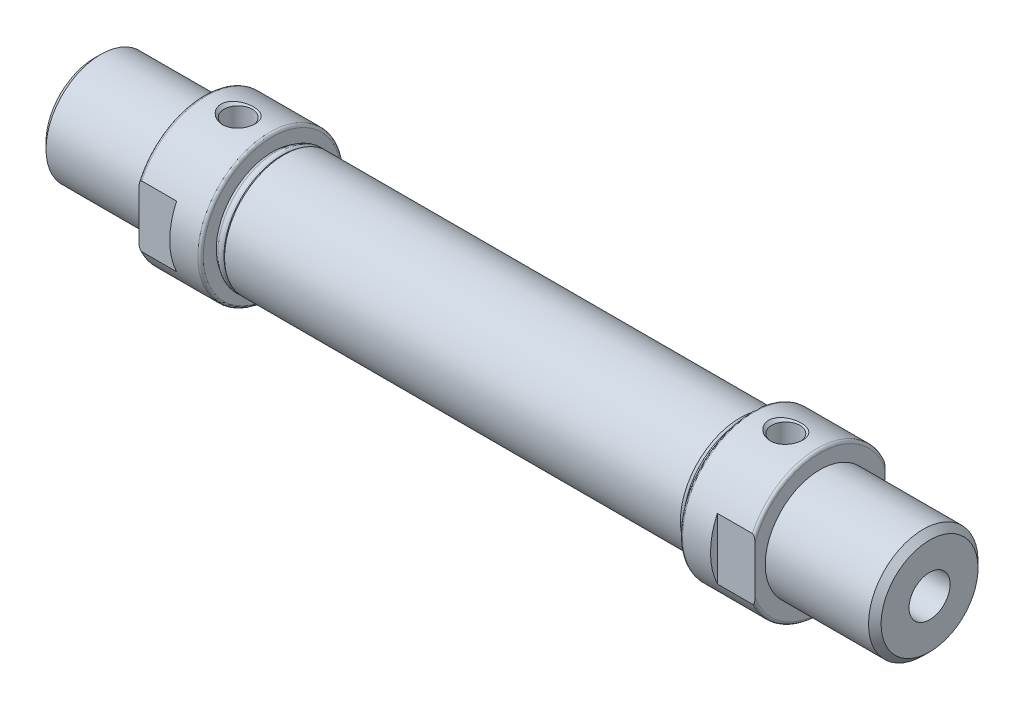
ISO-10303-21;
HEADER;
FILE_DESCRIPTION(('STEP AP214'),'2;1');
FILE_NAME('part.step','',(''),(''),'','','');
FILE_SCHEMA(('AUTOMOTIVE_DESIGN { 1 0 10303 214 1 1 1 1 }'));
ENDSEC;
DATA;
#1=APPLICATION_CONTEXT('core data for automotive mechanical design processes');
#2=APPLICATION_PROTOCOL_DEFINITION('international standard','automotive_design',2000,#1);
#3=PRODUCT_CONTEXT('',#1,'mechanical');
#4=PRODUCT('Part','Part','',(#3));
#5=PRODUCT_RELATED_PRODUCT_CATEGORY('part','',(#4));
#6=PRODUCT_DEFINITION_FORMATION('','',#4);
#7=PRODUCT_DEFINITION_CONTEXT('part definition',#1,'design');
#8=PRODUCT_DEFINITION('design','',#6,#7);
#9=PRODUCT_DEFINITION_SHAPE('','',#8);
#10=(LENGTH_UNIT() NAMED_UNIT(*) SI_UNIT(.MILLI.,.METRE.));
#11=(NAMED_UNIT(*) PLANE_ANGLE_UNIT() SI_UNIT($,.RADIAN.));
#12=(NAMED_UNIT(*) SI_UNIT($,.STERADIAN.) SOLID_ANGLE_UNIT());
#13=UNCERTAINTY_MEASURE_WITH_UNIT(LENGTH_MEASURE(1.E-05),#10,'distance_accuracy_value','');
#14=(GEOMETRIC_REPRESENTATION_CONTEXT(3) GLOBAL_UNCERTAINTY_ASSIGNED_CONTEXT((#13)) GLOBAL_UNIT_ASSIGNED_CONTEXT((#10,
#11,#12)) REPRESENTATION_CONTEXT('',''));
#15=CARTESIAN_POINT('',(0.,0.,0.));
#16=DIRECTION('',(0.,0.,1.));
#17=DIRECTION('',(1.,0.,0.));
#18=AXIS2_PLACEMENT_3D('',#15,#16,#17);
#19=CARTESIAN_POINT('',(122.,0.,0.));
#20=DIRECTION('',(-1.,0.,0.));
#21=DIRECTION('',(0.,0.,1.));
#22=AXIS2_PLACEMENT_3D('',#19,#20,#21);
#23=CYLINDRICAL_SURFACE('',#22,8.);
#24=CARTESIAN_POINT('',(36.,0.,0.));
#25=DIRECTION('',(-1.,0.,0.));
#26=DIRECTION('',(0.,0.,1.));
#27=AXIS2_PLACEMENT_3D('',#24,#25,#26);
#28=CIRCLE('',#27,8.);
#29=CARTESIAN_POINT('',(36.,0.,8.));
#30=VERTEX_POINT('',#29);
#31=EDGE_CURVE('E425',#30,#30,#28,.F.);
#32=ORIENTED_EDGE('',*,*,#31,.F.);
#33=EDGE_LOOP('',(#32));
#34=FACE_BOUND('',#33,.T.);
#35=CARTESIAN_POINT('',(86.,0.,0.));
#36=DIRECTION('',(-1.,0.,0.));
#37=DIRECTION('',(0.,0.,1.));
#38=AXIS2_PLACEMENT_3D('',#35,#36,#37);
#39=CIRCLE('',#38,8.);
#40=CARTESIAN_POINT('',(86.,0.,8.));
#41=VERTEX_POINT('',#40);
#42=EDGE_CURVE('E428',#41,#41,#39,.T.);
#43=ORIENTED_EDGE('',*,*,#42,.F.);
#44=EDGE_LOOP('',(#43));
#45=FACE_BOUND('',#44,.T.);
#46=ADVANCED_FACE('F17',(#34,#45),#23,.F.);
#47=CARTESIAN_POINT('',(86.,8.,0.));
#48=DIRECTION('',(-1.,0.,0.));
#49=DIRECTION('',(0.,0.,1.));
#50=AXIS2_PLACEMENT_3D('',#47,#48,#49);
#51=PLANE('',#50);
#52=CARTESIAN_POINT('',(86.,0.,0.));
#53=DIRECTION('',(-1.,0.,0.));
#54=DIRECTION('',(0.,0.,1.));
#55=AXIS2_PLACEMENT_3D('',#52,#53,#54);
#56=CIRCLE('',#55,3.);
#57=CARTESIAN_POINT('',(86.,0.,3.));
#58=VERTEX_POINT('',#57);
#59=EDGE_CURVE('E422',#58,#58,#56,.F.);
#60=ORIENTED_EDGE('',*,*,#59,.T.);
#61=EDGE_LOOP('',(#60));
#62=FACE_BOUND('',#61,.T.);
#63=ORIENTED_EDGE('',*,*,#42,.T.);
#64=EDGE_LOOP('',(#63));
#65=FACE_BOUND('',#64,.T.);
#66=ADVANCED_FACE('F976',(#62,#65),#51,.T.);
#67=CARTESIAN_POINT('',(36.,3.,0.));
#68=DIRECTION('',(1.,0.,0.));
#69=DIRECTION('',(0.,0.,-1.));
#70=AXIS2_PLACEMENT_3D('',#67,#68,#69);
#71=PLANE('',#70);
#72=ORIENTED_EDGE('',*,*,#31,.T.);
#73=EDGE_LOOP('',(#72));
#74=FACE_BOUND('',#73,.T.);
#75=CARTESIAN_POINT('',(36.,0.,0.));
#76=DIRECTION('',(-1.,0.,0.));
#77=DIRECTION('',(0.,0.,1.));
#78=AXIS2_PLACEMENT_3D('',#75,#76,#77);
#79=CIRCLE('',#78,3.);
#80=CARTESIAN_POINT('',(36.,0.,3.));
#81=VERTEX_POINT('',#80);
#82=EDGE_CURVE('E419',#81,#81,#79,.T.);
#83=ORIENTED_EDGE('',*,*,#82,.T.);
#84=EDGE_LOOP('',(#83));
#85=FACE_BOUND('',#84,.T.);
#86=ADVANCED_FACE('F973',(#74,#85),#71,.T.);
#87=CARTESIAN_POINT('',(122.,0.,0.));
#88=DIRECTION('',(-1.,0.,0.));
#89=DIRECTION('',(0.,0.,1.));
#90=AXIS2_PLACEMENT_3D('',#87,#88,#89);
#91=CYLINDRICAL_SURFACE('',#90,3.);
#92=CARTESIAN_POINT('',(122.,0.,0.));
#93=DIRECTION('',(-1.,0.,0.));
#94=DIRECTION('',(0.,0.,1.));
#95=AXIS2_PLACEMENT_3D('',#92,#93,#94);
#96=CIRCLE('',#95,3.);
#97=CARTESIAN_POINT('',(122.,0.,3.));
#98=VERTEX_POINT('',#97);
#99=EDGE_CURVE('E416',#98,#98,#96,.F.);
#100=ORIENTED_EDGE('',*,*,#99,.T.);
#101=EDGE_LOOP('',(#100));
#102=FACE_BOUND('',#101,.T.);
#103=ORIENTED_EDGE('',*,*,#59,.F.);
#104=EDGE_LOOP('',(#103));
#105=FACE_BOUND('',#104,.T.);
#106=ADVANCED_FACE('F969',(#102,#105),#91,.F.);
#107=CARTESIAN_POINT('',(122.,0.,0.));
#108=DIRECTION('',(-1.,0.,0.));
#109=DIRECTION('',(0.,0.,1.));
#110=AXIS2_PLACEMENT_3D('',#107,#108,#109);
#111=CYLINDRICAL_SURFACE('',#110,3.);
#112=ORIENTED_EDGE('',*,*,#82,.F.);
#113=EDGE_LOOP('',(#112));
#114=FACE_BOUND('',#113,.T.);
#115=CARTESIAN_POINT('',(0.,0.,0.));
#116=DIRECTION('',(-1.,0.,0.));
#117=DIRECTION('',(0.,0.,1.));
#118=AXIS2_PLACEMENT_3D('',#115,#116,#117);
#119=CIRCLE('',#118,3.);
#120=CARTESIAN_POINT('',(0.,0.,3.));
#121=VERTEX_POINT('',#120);
#122=EDGE_CURVE('E413',#121,#121,#119,.T.);
#123=ORIENTED_EDGE('',*,*,#122,.T.);
#124=EDGE_LOOP('',(#123));
#125=FACE_BOUND('',#124,.T.);
#126=ADVANCED_FACE('F965',(#114,#125),#111,.F.);
#127=CARTESIAN_POINT('',(122.,7.08,0.));
#128=DIRECTION('',(-1.,0.,0.));
#129=DIRECTION('',(0.,0.,1.));
#130=AXIS2_PLACEMENT_3D('',#127,#128,#129);
#131=PLANE('',#130);
#132=ORIENTED_EDGE('',*,*,#99,.F.);
#133=EDGE_LOOP('',(#132));
#134=FACE_BOUND('',#133,.T.);
#135=CARTESIAN_POINT('',(122.,0.,0.));
#136=DIRECTION('',(-1.,0.,0.));
#137=DIRECTION('',(0.,-1.,0.));
#138=AXIS2_PLACEMENT_3D('',#135,#136,#137);
#139=CIRCLE('',#138,7.08);
#140=CARTESIAN_POINT('',(122.,-7.08,0.));
#141=VERTEX_POINT('',#140);
#142=EDGE_CURVE('E410',#141,#141,#139,.T.);
#143=ORIENTED_EDGE('',*,*,#142,.F.);
#144=EDGE_LOOP('',(#143));
#145=FACE_BOUND('',#144,.T.);
#146=ADVANCED_FACE('F961',(#134,#145),#131,.F.);
#147=CARTESIAN_POINT('',(0.,0.,0.));
#148=DIRECTION('',(1.,0.,0.));
#149=DIRECTION('',(0.,0.,-1.));
#150=AXIS2_PLACEMENT_3D('',#147,#148,#149);
#151=PLANE('',#150);
#152=ORIENTED_EDGE('',*,*,#122,.F.);
#153=EDGE_LOOP('',(#152));
#154=FACE_BOUND('',#153,.T.);
#155=CARTESIAN_POINT('',(0.,0.,0.));
#156=DIRECTION('',(1.,0.,0.));
#157=DIRECTION('',(0.,0.,-1.));
#158=AXIS2_PLACEMENT_3D('',#155,#156,#157);
#159=CIRCLE('',#158,7.08);
#160=CARTESIAN_POINT('',(0.,0.,-7.08));
#161=VERTEX_POINT('',#160);
#162=EDGE_CURVE('E210',#161,#161,#159,.T.);
#163=ORIENTED_EDGE('',*,*,#162,.F.);
#164=EDGE_LOOP('',(#163));
#165=FACE_BOUND('',#164,.T.);
#166=ADVANCED_FACE('F957',(#154,#165),#151,.F.);
#167=CARTESIAN_POINT('',(121.08,0.,0.));
#168=DIRECTION('',(-1.,0.,0.));
#169=DIRECTION('',(0.,-1.,0.));
#170=AXIS2_PLACEMENT_3D('',#167,#168,#169);
#171=CONICAL_SURFACE('',#170,8.,0.785398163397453);
#172=ORIENTED_EDGE('',*,*,#142,.T.);
#173=EDGE_LOOP('',(#172));
#174=FACE_BOUND('',#173,.T.);
#175=CARTESIAN_POINT('',(121.08,0.,0.));
#176=DIRECTION('',(-1.,0.,0.));
#177=DIRECTION('',(0.,0.,1.));
#178=AXIS2_PLACEMENT_3D('',#175,#176,#177);
#179=CIRCLE('',#178,8.);
#180=CARTESIAN_POINT('',(121.08,0.,8.));
#181=VERTEX_POINT('',#180);
#182=EDGE_CURVE('E207',#181,#181,#179,.T.);
#183=ORIENTED_EDGE('',*,*,#182,.F.);
#184=EDGE_LOOP('',(#183));
#185=FACE_BOUND('',#184,.T.);
#186=ADVANCED_FACE('F953',(#174,#185),#171,.T.);
#187=CARTESIAN_POINT('',(0.920000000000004,0.,0.));
#188=DIRECTION('',(1.,0.,0.));
#189=DIRECTION('',(0.,0.,-1.));
#190=AXIS2_PLACEMENT_3D('',#187,#188,#189);
#191=CONICAL_SURFACE('',#190,8.,0.785398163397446);
#192=CARTESIAN_POINT('',(0.920000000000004,0.,0.));
#193=DIRECTION('',(-1.,0.,0.));
#194=DIRECTION('',(0.,0.,1.));
#195=AXIS2_PLACEMENT_3D('',#192,#193,#194);
#196=CIRCLE('',#195,8.);
#197=CARTESIAN_POINT('',(0.920000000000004,0.,8.));
#198=VERTEX_POINT('',#197);
#199=EDGE_CURVE('E198',#198,#198,#196,.F.);
#200=ORIENTED_EDGE('',*,*,#199,.F.);
#201=EDGE_LOOP('',(#200));
#202=FACE_BOUND('',#201,.T.);
#203=ORIENTED_EDGE('',*,*,#162,.T.);
#204=EDGE_LOOP('',(#203));
#205=FACE_BOUND('',#204,.T.);
#206=ADVANCED_FACE('F949',(#202,#205),#191,.T.);
#207=CARTESIAN_POINT('',(103.067,3.75,0.));
#208=DIRECTION('',(0.,1.,0.));
#209=DIRECTION('',(0.,0.,1.));
#210=AXIS2_PLACEMENT_3D('',#207,#208,#209);
#211=PLANE('',#210);
#212=CARTESIAN_POINT('',(101.,3.75,0.));
#213=DIRECTION('',(0.,1.,0.));
#214=DIRECTION('',(0.,0.,1.));
#215=AXIS2_PLACEMENT_3D('',#212,#213,#214);
#216=CIRCLE('',#215,2.067);
#217=CARTESIAN_POINT('',(101.,3.75,2.067));
#218=VERTEX_POINT('',#217);
#219=EDGE_CURVE('E206',#218,#218,#216,.T.);
#220=ORIENTED_EDGE('',*,*,#219,.T.);
#221=EDGE_LOOP('',(#220));
#222=FACE_BOUND('',#221,.T.);
#223=ADVANCED_FACE('F716',(#222),#211,.T.);
#224=CARTESIAN_POINT('',(122.,0.,0.));
#225=DIRECTION('',(-1.,0.,0.));
#226=DIRECTION('',(0.,0.,1.));
#227=AXIS2_PLACEMENT_3D('',#224,#225,#226);
#228=CYLINDRICAL_SURFACE('',#227,8.);
#229=ORIENTED_EDGE('',*,*,#182,.T.);
#230=EDGE_LOOP('',(#229));
#231=FACE_BOUND('',#230,.T.);
#232=CARTESIAN_POINT('',(106.,0.,0.));
#233=DIRECTION('',(-1.,0.,0.));
#234=DIRECTION('',(0.,0.,1.));
#235=AXIS2_PLACEMENT_3D('',#232,#233,#234);
#236=CIRCLE('',#235,8.);
#237=CARTESIAN_POINT('',(106.,0.,8.));
#238=VERTEX_POINT('',#237);
#239=EDGE_CURVE('E403',#238,#238,#236,.F.);
#240=ORIENTED_EDGE('',*,*,#239,.T.);
#241=EDGE_LOOP('',(#240));
#242=FACE_BOUND('',#241,.T.);
#243=ADVANCED_FACE('F711',(#231,#242),#228,.T.);
#244=CARTESIAN_POINT('',(23.067,3.75,0.));
#245=DIRECTION('',(0.,1.,0.));
#246=DIRECTION('',(0.,0.,1.));
#247=AXIS2_PLACEMENT_3D('',#244,#245,#246);
#248=PLANE('',#247);
#249=CARTESIAN_POINT('',(21.,3.75,0.));
#250=DIRECTION('',(0.,1.,0.));
#251=DIRECTION('',(0.,0.,1.));
#252=AXIS2_PLACEMENT_3D('',#249,#250,#251);
#253=CIRCLE('',#252,2.067);
#254=CARTESIAN_POINT('',(21.,3.75,2.067));
#255=VERTEX_POINT('',#254);
#256=EDGE_CURVE('E400',#255,#255,#253,.T.);
#257=ORIENTED_EDGE('',*,*,#256,.T.);
#258=EDGE_LOOP('',(#257));
#259=FACE_BOUND('',#258,.T.);
#260=ADVANCED_FACE('F704',(#259),#248,.T.);
#261=CARTESIAN_POINT('',(106.,0.,0.));
#262=DIRECTION('',(-1.,0.,0.));
#263=DIRECTION('',(0.,0.,1.));
#264=AXIS2_PLACEMENT_3D('',#261,#262,#263);
#265=CYLINDRICAL_SURFACE('',#264,8.);
#266=ORIENTED_EDGE('',*,*,#199,.T.);
#267=EDGE_LOOP('',(#266));
#268=FACE_BOUND('',#267,.T.);
#269=CARTESIAN_POINT('',(16.,0.,0.));
#270=DIRECTION('',(-1.,0.,0.));
#271=DIRECTION('',(0.,0.,1.));
#272=AXIS2_PLACEMENT_3D('',#269,#270,#271);
#273=CIRCLE('',#272,8.);
#274=CARTESIAN_POINT('',(16.,0.,8.));
#275=VERTEX_POINT('',#274);
#276=EDGE_CURVE('E396',#275,#275,#273,.T.);
#277=ORIENTED_EDGE('',*,*,#276,.T.);
#278=EDGE_LOOP('',(#277));
#279=FACE_BOUND('',#278,.T.);
#280=ADVANCED_FACE('F694',(#268,#279),#265,.T.);
#281=CARTESIAN_POINT('',(101.,3.75,0.));
#282=DIRECTION('',(0.,1.,0.));
#283=DIRECTION('',(0.,0.,1.));
#284=AXIS2_PLACEMENT_3D('',#281,#282,#283);
#285=CYLINDRICAL_SURFACE('',#284,2.067);
#286=CARTESIAN_POINT('',(101.,10.0669999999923,0.));
#287=DIRECTION('',(0.,1.,0.));
#288=DIRECTION('',(0.,0.,1.));
#289=AXIS2_PLACEMENT_3D('',#286,#287,#288);
#290=CIRCLE('',#289,2.06700000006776);
#291=CARTESIAN_POINT('',(101.,10.0669999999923,2.06700000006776));
#292=VERTEX_POINT('',#291);
#293=EDGE_CURVE('E367',#292,#292,#290,.T.);
#294=ORIENTED_EDGE('',*,*,#293,.T.);
#295=EDGE_LOOP('',(#294));
#296=FACE_BOUND('',#295,.T.);
#297=ORIENTED_EDGE('',*,*,#219,.F.);
#298=EDGE_LOOP('',(#297));
#299=FACE_BOUND('',#298,.T.);
#300=ADVANCED_FACE('F353',(#296,#299),#285,.F.);
#301=CARTESIAN_POINT('',(106.,10.1,0.));
#302=DIRECTION('',(-1.,0.,0.));
#303=DIRECTION('',(0.,0.,1.));
#304=AXIS2_PLACEMENT_3D('',#301,#302,#303);
#305=PLANE('',#304);
#306=CARTESIAN_POINT('',(106.,0.,0.));
#307=DIRECTION('',(-1.,0.,0.));
#308=DIRECTION('',(0.,-0.339533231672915,-0.940594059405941));
#309=AXIS2_PLACEMENT_3D('',#306,#307,#308);
#310=CIRCLE('',#309,10.1);
#311=CARTESIAN_POINT('',(106.,-3.42928563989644,-9.5));
#312=VERTEX_POINT('',#311);
#313=CARTESIAN_POINT('',(106.,-3.42928563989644,9.5));
#314=VERTEX_POINT('',#313);
#315=EDGE_CURVE('E399',#312,#314,#310,.T.);
#316=ORIENTED_EDGE('',*,*,#315,.F.);
#317=DIRECTION('',(0.,1.,0.));
#318=VECTOR('',#317,1.);
#319=CARTESIAN_POINT('',(106.,-10.5,-9.5));
#320=LINE('',#319,#318);
#321=CARTESIAN_POINT('',(106.,3.42928563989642,-9.5));
#322=VERTEX_POINT('',#321);
#323=EDGE_CURVE('E509',#322,#312,#320,.F.);
#324=ORIENTED_EDGE('',*,*,#323,.F.);
#325=CARTESIAN_POINT('',(106.,0.,0.));
#326=DIRECTION('',(-1.,0.,0.));
#327=DIRECTION('',(0.,0.339533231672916,0.940594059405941));
#328=AXIS2_PLACEMENT_3D('',#325,#326,#327);
#329=CIRCLE('',#328,10.1);
#330=CARTESIAN_POINT('',(106.,3.42928563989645,9.5));
#331=VERTEX_POINT('',#330);
#332=EDGE_CURVE('E129',#331,#322,#329,.T.);
#333=ORIENTED_EDGE('',*,*,#332,.F.);
#334=DIRECTION('',(0.,1.,0.));
#335=VECTOR('',#334,1.);
#336=CARTESIAN_POINT('',(106.,10.5,9.5));
#337=LINE('',#336,#335);
#338=EDGE_CURVE('E126',#314,#331,#337,.T.);
#339=ORIENTED_EDGE('',*,*,#338,.F.);
#340=EDGE_LOOP('',(#316,#324,#333,#339));
#341=FACE_BOUND('',#340,.T.);
#342=ORIENTED_EDGE('',*,*,#239,.F.);
#343=EDGE_LOOP('',(#342));
#344=FACE_BOUND('',#343,.T.);
#345=ADVANCED_FACE('F343',(#341,#344),#305,.F.);
#346=CARTESIAN_POINT('',(21.,3.75,0.));
#347=DIRECTION('',(0.,1.,0.));
#348=DIRECTION('',(0.,0.,1.));
#349=AXIS2_PLACEMENT_3D('',#346,#347,#348);
#350=CYLINDRICAL_SURFACE('',#349,2.067);
#351=CARTESIAN_POINT('',(21.,10.0670000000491,0.));
#352=DIRECTION('',(0.,1.,0.));
#353=DIRECTION('',(0.,0.,1.));
#354=AXIS2_PLACEMENT_3D('',#351,#352,#353);
#355=CIRCLE('',#354,2.06700000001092);
#356=CARTESIAN_POINT('',(21.,10.0670000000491,2.06700000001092));
#357=VERTEX_POINT('',#356);
#358=EDGE_CURVE('E293',#357,#357,#355,.T.);
#359=ORIENTED_EDGE('',*,*,#358,.T.);
#360=EDGE_LOOP('',(#359));
#361=FACE_BOUND('',#360,.T.);
#362=ORIENTED_EDGE('',*,*,#256,.F.);
#363=EDGE_LOOP('',(#362));
#364=FACE_BOUND('',#363,.T.);
#365=ADVANCED_FACE('F352',(#361,#364),#350,.F.);
#366=CARTESIAN_POINT('',(16.,8.,0.));
#367=DIRECTION('',(1.,0.,0.));
#368=DIRECTION('',(0.,0.,-1.));
#369=AXIS2_PLACEMENT_3D('',#366,#367,#368);
#370=PLANE('',#369);
#371=DIRECTION('',(0.,1.,0.));
#372=VECTOR('',#371,1.);
#373=CARTESIAN_POINT('',(16.,10.5,9.5));
#374=LINE('',#373,#372);
#375=CARTESIAN_POINT('',(16.,-3.42928563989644,9.5));
#376=VERTEX_POINT('',#375);
#377=CARTESIAN_POINT('',(16.,3.42928563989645,9.5));
#378=VERTEX_POINT('',#377);
#379=EDGE_CURVE('E262',#376,#378,#374,.T.);
#380=ORIENTED_EDGE('',*,*,#379,.T.);
#381=CARTESIAN_POINT('',(16.,0.,0.));
#382=DIRECTION('',(1.,0.,0.));
#383=DIRECTION('',(0.,0.339533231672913,-0.940594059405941));
#384=AXIS2_PLACEMENT_3D('',#381,#382,#383);
#385=CIRCLE('',#384,10.1);
#386=CARTESIAN_POINT('',(16.,3.42928563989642,-9.5));
#387=VERTEX_POINT('',#386);
#388=EDGE_CURVE('E298',#387,#378,#385,.T.);
#389=ORIENTED_EDGE('',*,*,#388,.F.);
#390=DIRECTION('',(0.,1.,0.));
#391=VECTOR('',#390,1.);
#392=CARTESIAN_POINT('',(16.,-10.5,-9.5));
#393=LINE('',#392,#391);
#394=CARTESIAN_POINT('',(16.,-3.42928563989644,-9.5));
#395=VERTEX_POINT('',#394);
#396=EDGE_CURVE('E290',#387,#395,#393,.F.);
#397=ORIENTED_EDGE('',*,*,#396,.T.);
#398=CARTESIAN_POINT('',(16.,0.,0.));
#399=DIRECTION('',(1.,0.,0.));
#400=DIRECTION('',(0.,-0.339533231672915,0.940594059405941));
#401=AXIS2_PLACEMENT_3D('',#398,#399,#400);
#402=CIRCLE('',#401,10.1);
#403=EDGE_CURVE('E508',#376,#395,#402,.T.);
#404=ORIENTED_EDGE('',*,*,#403,.F.);
#405=EDGE_LOOP('',(#380,#389,#397,#404));
#406=FACE_BOUND('',#405,.T.);
#407=ORIENTED_EDGE('',*,*,#276,.F.);
#408=EDGE_LOOP('',(#407));
#409=FACE_BOUND('',#408,.T.);
#410=ADVANCED_FACE('F175',(#406,#409),#370,.F.);
#411=CARTESIAN_POINT('',(105.6,0.,0.));
#412=DIRECTION('',(-1.,0.,0.));
#413=DIRECTION('',(0.,0.,1.));
#414=AXIS2_PLACEMENT_3D('',#411,#412,#413);
#415=TOROIDAL_SURFACE('',#414,10.1,0.400000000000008);
#416=CARTESIAN_POINT('',(106.,-3.42928563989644,-9.5));
#417=CARTESIAN_POINT('',(105.999966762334,-3.48288224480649,-9.50000000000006));
#418=CARTESIAN_POINT('',(105.998753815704,-3.53650979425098,-9.50000000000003));
#419=CARTESIAN_POINT('',(105.993435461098,-3.64386324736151,-9.49999999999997));
#420=CARTESIAN_POINT('',(105.989316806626,-3.69758847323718,-9.49999999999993));
#421=CARTESIAN_POINT('',(105.977683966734,-3.80431725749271,-9.50000000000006));
#422=CARTESIAN_POINT('',(105.970192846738,-3.85732323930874,-9.50000000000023));
#423=CARTESIAN_POINT('',(105.950979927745,-3.96249904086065,-9.49999999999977));
#424=CARTESIAN_POINT('',(105.939266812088,-4.01467034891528,-9.49999999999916));
#425=CARTESIAN_POINT('',(105.917235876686,-4.09248292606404,-9.49999999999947));
#426=CARTESIAN_POINT('',(105.909000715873,-4.11870921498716,-9.49999999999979));
#427=CARTESIAN_POINT('',(105.890654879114,-4.17067258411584,-9.50000000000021));
#428=CARTESIAN_POINT('',(105.880533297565,-4.19640580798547,-9.50000000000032));
#429=CARTESIAN_POINT('',(105.85425853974,-4.25534717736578,-9.49999999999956));
#430=CARTESIAN_POINT('',(105.837219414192,-4.28818822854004,-9.49999999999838));
#431=CARTESIAN_POINT('',(105.807490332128,-4.33464943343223,-9.5000000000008));
#432=CARTESIAN_POINT('',(105.796934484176,-4.34961706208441,-9.5000000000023));
#433=CARTESIAN_POINT('',(105.774153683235,-4.37820358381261,-9.4999999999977));
#434=CARTESIAN_POINT('',(105.761929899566,-4.39182341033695,-9.49999999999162));
#435=CARTESIAN_POINT('',(105.730568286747,-4.42165756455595,-9.49999999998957));
#436=CARTESIAN_POINT('',(105.71053118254,-4.4370197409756,-9.49999999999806));
#437=CARTESIAN_POINT('',(105.677369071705,-4.45476883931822,-9.50000000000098));
#438=CARTESIAN_POINT('',(105.665686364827,-4.45982215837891,-9.50000000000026));
#439=CARTESIAN_POINT('',(105.641560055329,-4.46748212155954,-9.49999999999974));
#440=CARTESIAN_POINT('',(105.629119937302,-4.47009918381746,-9.49999999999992));
#441=CARTESIAN_POINT('',(105.611055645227,-4.47187043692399,-9.50000000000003));
#442=CARTESIAN_POINT('',(105.605527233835,-4.47214397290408,-9.50000000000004));
#443=CARTESIAN_POINT('',(105.6,-4.47213595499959,-9.49999999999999));
#444=B_SPLINE_CURVE_WITH_KNOTS('',3,(#416,#417,#418,#419,#420,#421,#422,#423,#424,#425,#426,
#427,#428,#429,#430,#431,#432,#433,#434,#435,#436,#437,#438,#439,#440,#441,#442,#443),
.UNSPECIFIED.,.F.,.F.,(4,2,2,2,2,2,2,2,2,2,2,2,2,4),(0.,0.160825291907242,0.322388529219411,
0.482863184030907,0.643009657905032,0.725418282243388,0.808318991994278,0.91884888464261,
0.973689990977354,1.02849284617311,1.10318375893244,1.14116883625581,1.17899072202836,
1.19557156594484),.UNSPECIFIED.);
#445=CARTESIAN_POINT('',(105.6,-4.47213595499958,-9.5));
#446=VERTEX_POINT('',#445);
#447=EDGE_CURVE('E507',#312,#446,#444,.T.);
#448=ORIENTED_EDGE('',*,*,#447,.F.);
#449=ORIENTED_EDGE('',*,*,#315,.T.);
#450=CARTESIAN_POINT('',(105.6,-4.47213595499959,9.5));
#451=CARTESIAN_POINT('',(105.610514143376,-4.47216378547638,9.5));
#452=CARTESIAN_POINT('',(105.620991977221,-4.47116407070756,9.5));
#453=CARTESIAN_POINT('',(105.641499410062,-4.46736714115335,9.5));
#454=CARTESIAN_POINT('',(105.651532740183,-4.46459040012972,9.5));
#455=CARTESIAN_POINT('',(105.673334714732,-4.45664513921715,9.5));
#456=CARTESIAN_POINT('',(105.684951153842,-4.45106576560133,9.5));
#457=CARTESIAN_POINT('',(105.707166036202,-4.43810179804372,9.5));
#458=CARTESIAN_POINT('',(105.71775943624,-4.43070883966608,9.49999999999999));
#459=CARTESIAN_POINT('',(105.743865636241,-4.40985262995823,9.49999999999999));
#460=CARTESIAN_POINT('',(105.758570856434,-4.39538928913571,9.5));
#461=CARTESIAN_POINT('',(105.785702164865,-4.36449939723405,9.5));
#462=CARTESIAN_POINT('',(105.798123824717,-4.34806913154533,9.5));
#463=CARTESIAN_POINT('',(105.821022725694,-4.31410030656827,9.5));
#464=CARTESIAN_POINT('',(105.831513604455,-4.29657079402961,9.5));
#465=CARTESIAN_POINT('',(105.85099968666,-4.26069020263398,9.5));
#466=CARTESIAN_POINT('',(105.859993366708,-4.24233831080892,9.5));
#467=CARTESIAN_POINT('',(105.876781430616,-4.20495095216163,9.5));
#468=CARTESIAN_POINT('',(105.884567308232,-4.18591170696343,9.5));
#469=CARTESIAN_POINT('',(105.89905338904,-4.14744025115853,9.5));
#470=CARTESIAN_POINT('',(105.905754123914,-4.12800823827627,9.5));
#471=CARTESIAN_POINT('',(105.923855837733,-4.07118130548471,9.5));
#472=CARTESIAN_POINT('',(105.934042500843,-4.03339887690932,9.5));
#473=CARTESIAN_POINT('',(105.9517866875,-3.95717407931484,9.5));
#474=CARTESIAN_POINT('',(105.95933949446,-3.91873065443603,9.5));
#475=CARTESIAN_POINT('',(105.972273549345,-3.84140900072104,9.5));
#476=CARTESIAN_POINT('',(105.977650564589,-3.80253007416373,9.5));
#477=CARTESIAN_POINT('',(105.98632931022,-3.72643416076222,9.5));
#478=CARTESIAN_POINT('',(105.989718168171,-3.68922684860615,9.5));
#479=CARTESIAN_POINT('',(105.995011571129,-3.6148038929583,9.5));
#480=CARTESIAN_POINT('',(105.996919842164,-3.57758850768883,9.5));
#481=CARTESIAN_POINT('',(105.999406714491,-3.50334192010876,9.5));
#482=CARTESIAN_POINT('',(105.999993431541,-3.46631099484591,9.5));
#483=CARTESIAN_POINT('',(106.,-3.42928563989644,9.49999999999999));
#484=B_SPLINE_CURVE_WITH_KNOTS('',3,(#450,#451,#452,#453,#454,#455,#456,#457,#458,#459,#460,
#461,#462,#463,#464,#465,#466,#467,#468,#469,#470,#471,#472,#473,#474,#475,#476,#477,#478,#479,
#480,#481,#482,#483),.UNSPECIFIED.,.F.,.F.,(4,2,2,2,2,2,2,2,2,2,2,2,2,2,2,2,4),(0.,
0.0314363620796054,0.0625168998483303,0.100962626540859,0.139589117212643,0.201119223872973,
0.262767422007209,0.323961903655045,0.385218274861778,0.446888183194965,0.508527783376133,
0.625784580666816,0.743250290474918,0.860943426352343,0.972994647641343,1.08476295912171,
1.19584300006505),.UNSPECIFIED.);
#485=CARTESIAN_POINT('',(105.6,-4.47213595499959,9.5));
#486=VERTEX_POINT('',#485);
#487=EDGE_CURVE('E154',#486,#314,#484,.T.);
#488=ORIENTED_EDGE('',*,*,#487,.F.);
#489=CARTESIAN_POINT('',(105.6,0.,0.));
#490=DIRECTION('',(-1.,0.,0.));
#491=DIRECTION('',(0.,0.,1.));
#492=AXIS2_PLACEMENT_3D('',#489,#490,#491);
#493=CIRCLE('',#492,10.5);
#494=EDGE_CURVE('E161',#446,#486,#493,.T.);
#495=ORIENTED_EDGE('',*,*,#494,.F.);
#496=EDGE_LOOP('',(#448,#449,#488,#495));
#497=FACE_BOUND('',#496,.T.);
#498=ADVANCED_FACE('F169',(#497),#415,.T.);
#499=CARTESIAN_POINT('',(101.,10.5026217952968,0.));
#500=DIRECTION('',(0.,1.,0.));
#501=DIRECTION('',(0.,0.,1.));
#502=AXIS2_PLACEMENT_3D('',#499,#500,#501);
#503=CONICAL_SURFACE('',#502,2.50262179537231,0.785398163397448);
#504=CARTESIAN_POINT('',(101.,10.2549980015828,2.25499800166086));
#505=CARTESIAN_POINT('',(100.84955994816,10.255001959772,2.25499283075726));
#506=CARTESIAN_POINT('',(100.698926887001,10.257744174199,2.24261957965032));
#507=CARTESIAN_POINT('',(100.401697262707,10.2684060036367,2.19327478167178));
#508=CARTESIAN_POINT('',(100.255109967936,10.2763366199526,2.15625096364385));
#509=CARTESIAN_POINT('',(99.9707244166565,10.2964049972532,2.0582836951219));
#510=CARTESIAN_POINT('',(99.832910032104,10.3085347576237,1.99738570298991));
#511=CARTESIAN_POINT('',(99.5701721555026,10.33551487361,1.85270713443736));
#512=CARTESIAN_POINT('',(99.44524321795,10.3503640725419,1.76893627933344));
#513=CARTESIAN_POINT('',(99.2168156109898,10.3803436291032,1.58334215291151));
#514=CARTESIAN_POINT('',(99.1127216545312,10.3954461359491,1.48225007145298));
#515=CARTESIAN_POINT('',(98.9251131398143,10.4244359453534,1.26229182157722));
#516=CARTESIAN_POINT('',(98.8415854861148,10.4383240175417,1.14343704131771));
#517=CARTESIAN_POINT('',(98.7061390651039,10.4617286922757,0.903008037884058));
#518=CARTESIAN_POINT('',(98.6520036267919,10.4715316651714,0.782713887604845));
#519=CARTESIAN_POINT('',(98.5672867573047,10.4871562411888,0.533873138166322));
#520=CARTESIAN_POINT('',(98.5366824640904,10.4929817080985,0.405334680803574));
#521=CARTESIAN_POINT('',(98.502892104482,10.4994355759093,0.159127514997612));
#522=CARTESIAN_POINT('',(98.4970443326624,10.5005681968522,0.0418320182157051));
#523=CARTESIAN_POINT('',(98.5057466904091,10.4988952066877,-0.191954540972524));
#524=CARTESIAN_POINT('',(98.5202914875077,10.4960906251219,-0.308445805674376));
#525=CARTESIAN_POINT('',(98.5679258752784,10.4870832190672,-0.532052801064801));
#526=CARTESIAN_POINT('',(98.600177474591,10.4810342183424,-0.639355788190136));
#527=CARTESIAN_POINT('',(98.6811733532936,10.466275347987,-0.847325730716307));
#528=CARTESIAN_POINT('',(98.7299203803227,10.4575650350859,-0.947991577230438));
#529=CARTESIAN_POINT('',(98.8448606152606,10.4378325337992,-1.14542314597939));
#530=CARTESIAN_POINT('',(98.9118066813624,10.4267162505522,-1.24173950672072));
#531=CARTESIAN_POINT('',(99.05948068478,10.4035317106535,-1.42298747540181));
#532=CARTESIAN_POINT('',(99.1402128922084,10.3914631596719,-1.50791554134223));
#533=CARTESIAN_POINT('',(99.3220255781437,10.3661950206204,-1.67323135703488));
#534=CARTESIAN_POINT('',(99.4243439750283,10.3530064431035,-1.75225905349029));
#535=CARTESIAN_POINT('',(99.6400100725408,10.3280427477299,-1.89386277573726));
#536=CARTESIAN_POINT('',(99.7533669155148,10.3162688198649,-1.95642500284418));
#537=CARTESIAN_POINT('',(99.9996258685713,10.294221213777,-2.06945773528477));
#538=CARTESIAN_POINT('',(100.133357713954,10.2842031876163,-2.11817087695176));
#539=CARTESIAN_POINT('',(100.406868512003,10.2683053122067,-2.19395091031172));
#540=CARTESIAN_POINT('',(100.546637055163,10.2624186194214,-2.22105360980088));
#541=CARTESIAN_POINT('',(100.73941382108,10.2576031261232,-2.24312269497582));
#542=CARTESIAN_POINT('',(100.791420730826,10.2566282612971,-2.24757359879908));
#543=CARTESIAN_POINT('',(100.895610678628,10.2553250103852,-2.25351215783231));
#544=CARTESIAN_POINT('',(100.947793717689,10.2549966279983,-2.25499979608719));
#545=CARTESIAN_POINT('',(101.15044005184,10.2550019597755,-2.25499283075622));
#546=CARTESIAN_POINT('',(101.301073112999,10.2577441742,-2.24261957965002));
#547=CARTESIAN_POINT('',(101.598302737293,10.2684060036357,-2.19327478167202));
#548=CARTESIAN_POINT('',(101.744890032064,10.2763366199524,-2.1562509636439));
#549=CARTESIAN_POINT('',(102.029275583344,10.2964049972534,-2.05828369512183));
#550=CARTESIAN_POINT('',(102.167089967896,10.3085347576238,-1.99738570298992));
#551=CARTESIAN_POINT('',(102.429827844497,10.3355148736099,-1.8527071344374));
#552=CARTESIAN_POINT('',(102.55475678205,10.3503640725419,-1.76893627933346));
#553=CARTESIAN_POINT('',(102.78318438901,10.3803436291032,-1.5833421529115));
#554=CARTESIAN_POINT('',(102.887278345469,10.3954461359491,-1.48225007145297));
#555=CARTESIAN_POINT('',(103.074886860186,10.4244359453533,-1.26229182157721));
#556=CARTESIAN_POINT('',(103.158414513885,10.4383240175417,-1.14343704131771));
#557=CARTESIAN_POINT('',(103.293860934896,10.4617286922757,-0.903008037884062));
#558=CARTESIAN_POINT('',(103.347996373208,10.4715316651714,-0.782713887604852));
#559=CARTESIAN_POINT('',(103.432713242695,10.4871562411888,-0.533873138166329));
#560=CARTESIAN_POINT('',(103.46331753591,10.4929817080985,-0.405334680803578));
#561=CARTESIAN_POINT('',(103.497107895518,10.4994355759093,-0.159127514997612));
#562=CARTESIAN_POINT('',(103.502955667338,10.5005681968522,-0.0418320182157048));
#563=CARTESIAN_POINT('',(103.494253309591,10.4988952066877,0.191954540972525));
#564=CARTESIAN_POINT('',(103.479708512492,10.4960906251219,0.308445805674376));
#565=CARTESIAN_POINT('',(103.432074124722,10.4870832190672,0.532052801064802));
#566=CARTESIAN_POINT('',(103.399822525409,10.4810342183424,0.639355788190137));
#567=CARTESIAN_POINT('',(103.318826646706,10.466275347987,0.847325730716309));
#568=CARTESIAN_POINT('',(103.270079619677,10.4575650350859,0.947991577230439));
#569=CARTESIAN_POINT('',(103.155139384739,10.4378325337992,1.14542314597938));
#570=CARTESIAN_POINT('',(103.088193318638,10.4267162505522,1.24173950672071));
#571=CARTESIAN_POINT('',(102.94051931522,10.4035317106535,1.4229874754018));
#572=CARTESIAN_POINT('',(102.859787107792,10.3914631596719,1.50791554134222));
#573=CARTESIAN_POINT('',(102.677974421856,10.3661950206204,1.67323135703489));
#574=CARTESIAN_POINT('',(102.575656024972,10.3530064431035,1.75225905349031));
#575=CARTESIAN_POINT('',(102.359989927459,10.3280427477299,1.89386277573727));
#576=CARTESIAN_POINT('',(102.246633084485,10.3162688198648,1.9564250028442));
#577=CARTESIAN_POINT('',(102.000374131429,10.294221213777,2.06945773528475));
#578=CARTESIAN_POINT('',(101.866642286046,10.2842031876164,2.11817087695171));
#579=CARTESIAN_POINT('',(101.593131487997,10.2683053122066,2.19395091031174));
#580=CARTESIAN_POINT('',(101.453362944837,10.262418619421,2.22105360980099));
#581=CARTESIAN_POINT('',(101.26058617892,10.2576031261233,2.24312269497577));
#582=CARTESIAN_POINT('',(101.208579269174,10.2566282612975,2.24757359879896));
#583=CARTESIAN_POINT('',(101.104389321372,10.2553250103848,2.25351215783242));
#584=CARTESIAN_POINT('',(101.052206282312,10.2549966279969,2.25499979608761));
#585=CARTESIAN_POINT('',(101.,10.2549980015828,2.25499800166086));
#586=B_SPLINE_CURVE_WITH_KNOTS('',3,(#504,#505,#506,#507,#508,#509,#510,#511,#512,#513,#514,
#515,#516,#517,#518,#519,#520,#521,#522,#523,#524,#525,#526,#527,#528,#529,#530,#531,#532,#533,
#534,#535,#536,#537,#538,#539,#540,#541,#542,#543,#544,#545,#546,#547,#548,#549,#550,#551,#552,
#553,#554,#555,#556,#557,#558,#559,#560,#561,#562,#563,#564,#565,#566,#567,#568,#569,#570,#571,
#572,#573,#574,#575,#576,#577,#578,#579,#580,#581,#582,#583,#584,#585),.UNSPECIFIED.,.T.,.F.,(4,
2,2,2,2,2,2,2,2,2,2,2,2,2,2,2,2,2,2,2,2,2,2,2,2,2,2,2,2,2,2,2,2,2,2,2,2,2,2,2,4),(0.,
0.451124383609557,0.903208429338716,1.35443581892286,1.80547172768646,2.2407829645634,
2.67581629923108,3.0704057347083,3.4646113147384,3.81514877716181,4.16559459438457,
4.50072932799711,4.8359199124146,5.18793451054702,5.54005833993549,5.92831327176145,
6.31689254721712,6.74309692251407,7.16859361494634,7.32514362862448,7.48169453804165,
7.93281892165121,8.38490296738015,8.83613035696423,9.2871662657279,9.72247750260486,
10.1575108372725,10.5521002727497,10.9463058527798,11.2968433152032,11.647289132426,
11.9824238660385,12.317614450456,12.6696290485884,13.0217528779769,13.4100078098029,
13.7985870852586,14.2247914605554,14.6502881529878,14.8068381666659,14.963389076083),.UNSPECIFIED.);
#587=CARTESIAN_POINT('',(101.,10.2549980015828,2.25499800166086));
#588=VERTEX_POINT('',#587);
#589=EDGE_CURVE('E160',#588,#588,#586,.T.);
#590=ORIENTED_EDGE('',*,*,#589,.F.);
#591=EDGE_LOOP('',(#590));
#592=FACE_BOUND('',#591,.T.);
#593=ORIENTED_EDGE('',*,*,#293,.F.);
#594=EDGE_LOOP('',(#593));
#595=FACE_BOUND('',#594,.T.);
#596=ADVANCED_FACE('F174',(#592,#595),#503,.F.);
#597=CARTESIAN_POINT('',(100.5,0.,0.));
#598=DIRECTION('',(1.,0.,0.));
#599=DIRECTION('',(0.,0.,-1.));
#600=AXIS2_PLACEMENT_3D('',#597,#598,#599);
#601=PLANE('',#600);
#602=CARTESIAN_POINT('',(100.5,0.,0.));
#603=DIRECTION('',(-1.,0.,0.));
#604=DIRECTION('',(0.,0.,1.));
#605=AXIS2_PLACEMENT_3D('',#602,#603,#604);
#606=CIRCLE('',#605,10.5);
#607=CARTESIAN_POINT('',(100.5,4.47213595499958,-9.5));
#608=VERTEX_POINT('',#607);
#609=CARTESIAN_POINT('',(100.5,-4.47213595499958,-9.5));
#610=VERTEX_POINT('',#609);
#611=EDGE_CURVE('E147',#608,#610,#606,.T.);
#612=ORIENTED_EDGE('',*,*,#611,.F.);
#613=DIRECTION('',(0.,1.,0.));
#614=VECTOR('',#613,1.);
#615=CARTESIAN_POINT('',(100.5,-10.5,-9.5));
#616=LINE('',#615,#614);
#617=EDGE_CURVE('E515',#610,#608,#616,.T.);
#618=ORIENTED_EDGE('',*,*,#617,.F.);
#619=EDGE_LOOP('',(#612,#618));
#620=FACE_BOUND('',#619,.T.);
#621=ADVANCED_FACE('F523',(#620),#601,.T.);
#622=CARTESIAN_POINT('',(100.5,0.,0.));
#623=DIRECTION('',(1.,0.,0.));
#624=DIRECTION('',(0.,0.,-1.));
#625=AXIS2_PLACEMENT_3D('',#622,#623,#624);
#626=PLANE('',#625);
#627=CARTESIAN_POINT('',(100.5,0.,0.));
#628=DIRECTION('',(-1.,0.,0.));
#629=DIRECTION('',(0.,0.,1.));
#630=AXIS2_PLACEMENT_3D('',#627,#628,#629);
#631=CIRCLE('',#630,10.5);
#632=CARTESIAN_POINT('',(100.5,-4.47213595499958,9.5));
#633=VERTEX_POINT('',#632);
#634=CARTESIAN_POINT('',(100.5,4.47213595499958,9.5));
#635=VERTEX_POINT('',#634);
#636=EDGE_CURVE('E145',#633,#635,#631,.T.);
#637=ORIENTED_EDGE('',*,*,#636,.F.);
#638=DIRECTION('',(0.,1.,0.));
#639=VECTOR('',#638,1.);
#640=CARTESIAN_POINT('',(100.5,10.5,9.5));
#641=LINE('',#640,#639);
#642=EDGE_CURVE('E130',#635,#633,#641,.F.);
#643=ORIENTED_EDGE('',*,*,#642,.F.);
#644=EDGE_LOOP('',(#637,#643));
#645=FACE_BOUND('',#644,.T.);
#646=ADVANCED_FACE('F525',(#645),#626,.T.);
#647=CARTESIAN_POINT('',(100.5,10.5,9.5));
#648=DIRECTION('',(0.,0.,1.));
#649=DIRECTION('',(1.,0.,0.));
#650=AXIS2_PLACEMENT_3D('',#647,#648,#649);
#651=PLANE('',#650);
#652=DIRECTION('',(-1.,0.,0.));
#653=VECTOR('',#652,1.);
#654=CARTESIAN_POINT('',(106.,4.47213595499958,9.5));
#655=LINE('',#654,#653);
#656=CARTESIAN_POINT('',(105.600000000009,4.47213595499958,9.5));
#657=VERTEX_POINT('',#656);
#658=EDGE_CURVE('E122',#635,#657,#655,.F.);
#659=ORIENTED_EDGE('',*,*,#658,.F.);
#660=ORIENTED_EDGE('',*,*,#642,.T.);
#661=DIRECTION('',(-1.,0.,0.));
#662=VECTOR('',#661,1.);
#663=CARTESIAN_POINT('',(106.,-4.47213595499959,9.49999999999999));
#664=LINE('',#663,#662);
#665=EDGE_CURVE('E158',#486,#633,#664,.T.);
#666=ORIENTED_EDGE('',*,*,#665,.F.);
#667=ORIENTED_EDGE('',*,*,#487,.T.);
#668=ORIENTED_EDGE('',*,*,#338,.T.);
#669=CARTESIAN_POINT('',(105.600000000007,4.47213595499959,9.5));
#670=CARTESIAN_POINT('',(105.610514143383,4.47216378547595,9.5));
#671=CARTESIAN_POINT('',(105.620991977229,4.47116407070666,9.5));
#672=CARTESIAN_POINT('',(105.641499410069,4.46736714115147,9.5));
#673=CARTESIAN_POINT('',(105.651532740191,4.46459040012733,9.5));
#674=CARTESIAN_POINT('',(105.67333471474,4.45664513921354,9.5));
#675=CARTESIAN_POINT('',(105.68495115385,4.45106576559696,9.5));
#676=CARTESIAN_POINT('',(105.707166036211,4.43810179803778,9.5));
#677=CARTESIAN_POINT('',(105.717759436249,4.43070883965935,9.5));
#678=CARTESIAN_POINT('',(105.743865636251,4.40985262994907,9.5));
#679=CARTESIAN_POINT('',(105.758570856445,4.39538928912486,9.5));
#680=CARTESIAN_POINT('',(105.785702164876,4.36449939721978,9.5));
#681=CARTESIAN_POINT('',(105.798123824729,4.34806913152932,9.5));
#682=CARTESIAN_POINT('',(105.821022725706,4.31410030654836,9.5));
#683=CARTESIAN_POINT('',(105.831513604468,4.29657079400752,9.5));
#684=CARTESIAN_POINT('',(105.850999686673,4.26069020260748,9.5));
#685=CARTESIAN_POINT('',(105.859993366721,4.2423383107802,9.5));
#686=CARTESIAN_POINT('',(105.87678143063,4.20495095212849,9.5));
#687=CARTESIAN_POINT('',(105.884567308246,4.18591170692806,9.5));
#688=CARTESIAN_POINT('',(105.899053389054,4.14744025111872,9.5));
#689=CARTESIAN_POINT('',(105.905754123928,4.12800823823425,9.5));
#690=CARTESIAN_POINT('',(105.923855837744,4.07118130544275,9.49999999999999));
#691=CARTESIAN_POINT('',(105.934042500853,4.03339887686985,9.5));
#692=CARTESIAN_POINT('',(105.951786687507,3.95717407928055,9.5));
#693=CARTESIAN_POINT('',(105.959339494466,3.91873065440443,9.5));
#694=CARTESIAN_POINT('',(105.972273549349,3.84140900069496,9.5));
#695=CARTESIAN_POINT('',(105.977650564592,3.80253007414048,9.5));
#696=CARTESIAN_POINT('',(105.986329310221,3.72643416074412,9.5));
#697=CARTESIAN_POINT('',(105.989718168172,3.68922684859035,9.5));
#698=CARTESIAN_POINT('',(105.995011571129,3.61480389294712,9.5));
#699=CARTESIAN_POINT('',(105.996919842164,3.57758850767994,9.5));
#700=CARTESIAN_POINT('',(105.999406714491,3.50334192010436,9.5));
#701=CARTESIAN_POINT('',(105.999993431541,3.46631099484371,9.5));
#702=CARTESIAN_POINT('',(106.,3.42928563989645,9.5));
#703=B_SPLINE_CURVE_WITH_KNOTS('',3,(#669,#670,#671,#672,#673,#674,#675,#676,#677,#678,#679,
#680,#681,#682,#683,#684,#685,#686,#687,#688,#689,#690,#691,#692,#693,#694,#695,#696,#697,#698,
#699,#700,#701,#702),.UNSPECIFIED.,.F.,.F.,(4,2,2,2,2,2,2,2,2,2,2,2,2,2,2,2,4),(0.,
0.031436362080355,0.0625168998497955,0.100962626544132,0.139589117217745,0.201119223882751,
0.262767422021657,0.323961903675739,0.385218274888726,0.446888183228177,0.508527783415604,
0.625784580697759,0.743250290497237,0.860943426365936,0.972994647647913,1.08476295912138,
1.19584300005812),.UNSPECIFIED.);
#704=EDGE_CURVE('E117',#657,#331,#703,.T.);
#705=ORIENTED_EDGE('',*,*,#704,.F.);
#706=EDGE_LOOP('',(#659,#660,#666,#667,#668,#705));
#707=FACE_BOUND('',#706,.T.);
#708=ADVANCED_FACE('F119',(#707),#651,.T.);
#709=CARTESIAN_POINT('',(105.6,0.,0.));
#710=DIRECTION('',(-1.,0.,0.));
#711=DIRECTION('',(0.,0.,1.));
#712=AXIS2_PLACEMENT_3D('',#709,#710,#711);
#713=TOROIDAL_SURFACE('',#712,10.1,0.400000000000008);
#714=CARTESIAN_POINT('',(105.600000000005,4.47213595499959,-9.5));
#715=CARTESIAN_POINT('',(105.610514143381,4.4721637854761,-9.5));
#716=CARTESIAN_POINT('',(105.620991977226,4.47116407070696,-9.5));
#717=CARTESIAN_POINT('',(105.641499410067,4.4673671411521,-9.5));
#718=CARTESIAN_POINT('',(105.651532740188,4.46459040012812,-9.5));
#719=CARTESIAN_POINT('',(105.673334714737,4.45664513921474,-9.5));
#720=CARTESIAN_POINT('',(105.684951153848,4.45106576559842,-9.5));
#721=CARTESIAN_POINT('',(105.707166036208,4.43810179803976,-9.5));
#722=CARTESIAN_POINT('',(105.717759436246,4.43070883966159,-9.5));
#723=CARTESIAN_POINT('',(105.743865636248,4.40985262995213,-9.5));
#724=CARTESIAN_POINT('',(105.758570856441,4.39538928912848,-9.5));
#725=CARTESIAN_POINT('',(105.785702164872,4.36449939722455,-9.5));
#726=CARTESIAN_POINT('',(105.798123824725,4.34806913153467,-9.5));
#727=CARTESIAN_POINT('',(105.821022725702,4.31410030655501,-9.5));
#728=CARTESIAN_POINT('',(105.831513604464,4.2965707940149,-9.5));
#729=CARTESIAN_POINT('',(105.850999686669,4.26069020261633,-9.5));
#730=CARTESIAN_POINT('',(105.859993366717,4.24233831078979,-9.5));
#731=CARTESIAN_POINT('',(105.876781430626,4.20495095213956,-9.5));
#732=CARTESIAN_POINT('',(105.884567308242,4.18591170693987,-9.5));
#733=CARTESIAN_POINT('',(105.89905338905,4.14744025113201,-9.5));
#734=CARTESIAN_POINT('',(105.905754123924,4.12800823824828,-9.49999999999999));
#735=CARTESIAN_POINT('',(105.923855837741,4.07118130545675,-9.49999999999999));
#736=CARTESIAN_POINT('',(105.93404250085,4.03339887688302,-9.5));
#737=CARTESIAN_POINT('',(105.951786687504,3.95717407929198,-9.5));
#738=CARTESIAN_POINT('',(105.959339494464,3.91873065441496,-9.5));
#739=CARTESIAN_POINT('',(105.972273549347,3.84140900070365,-9.5));
#740=CARTESIAN_POINT('',(105.977650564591,3.80253007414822,-9.5));
#741=CARTESIAN_POINT('',(105.986329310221,3.72643416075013,-9.5));
#742=CARTESIAN_POINT('',(105.989718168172,3.6892268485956,-9.5));
#743=CARTESIAN_POINT('',(105.995011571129,3.61480389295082,-9.5));
#744=CARTESIAN_POINT('',(105.996919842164,3.57758850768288,-9.5));
#745=CARTESIAN_POINT('',(105.999406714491,3.5033419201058,-9.5));
#746=CARTESIAN_POINT('',(105.999993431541,3.46631099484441,-9.5));
#747=CARTESIAN_POINT('',(106.,3.42928563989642,-9.49999999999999));
#748=B_SPLINE_CURVE_WITH_KNOTS('',3,(#714,#715,#716,#717,#718,#719,#720,#721,#722,#723,#724,
#725,#726,#727,#728,#729,#730,#731,#732,#733,#734,#735,#736,#737,#738,#739,#740,#741,#742,#743,
#744,#745,#746,#747),.UNSPECIFIED.,.F.,.F.,(4,2,2,2,2,2,2,2,2,2,2,2,2,2,2,2,4),(0.,
0.0314363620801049,0.0625168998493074,0.100962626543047,0.139589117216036,0.201119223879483,
0.262767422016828,0.323961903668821,0.385218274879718,0.446888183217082,0.50852778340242,
0.625784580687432,0.743250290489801,0.860943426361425,0.972994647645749,1.08476295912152,
1.19584300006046),.UNSPECIFIED.);
#749=CARTESIAN_POINT('',(105.600000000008,4.47213595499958,-9.5));
#750=VERTEX_POINT('',#749);
#751=EDGE_CURVE('E136',#750,#322,#748,.T.);
#752=ORIENTED_EDGE('',*,*,#751,.F.);
#753=CARTESIAN_POINT('',(105.600000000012,0.,0.));
#754=DIRECTION('',(-1.,0.,0.));
#755=DIRECTION('',(0.,0.,1.));
#756=AXIS2_PLACEMENT_3D('',#753,#754,#755);
#757=CIRCLE('',#756,10.5);
#758=EDGE_CURVE('E133',#657,#750,#757,.T.);
#759=ORIENTED_EDGE('',*,*,#758,.F.);
#760=ORIENTED_EDGE('',*,*,#704,.T.);
#761=ORIENTED_EDGE('',*,*,#332,.T.);
#762=EDGE_LOOP('',(#752,#759,#760,#761));
#763=FACE_BOUND('',#762,.T.);
#764=ADVANCED_FACE('F134',(#763),#713,.T.);
#765=CARTESIAN_POINT('',(100.5,-10.5,-9.5));
#766=DIRECTION('',(0.,0.,-1.));
#767=DIRECTION('',(-1.,0.,0.));
#768=AXIS2_PLACEMENT_3D('',#765,#766,#767);
#769=PLANE('',#768);
#770=ORIENTED_EDGE('',*,*,#323,.T.);
#771=ORIENTED_EDGE('',*,*,#447,.T.);
#772=DIRECTION('',(-1.,0.,0.));
#773=VECTOR('',#772,1.);
#774=CARTESIAN_POINT('',(106.,-4.47213595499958,-9.5));
#775=LINE('',#774,#773);
#776=EDGE_CURVE('E164',#610,#446,#775,.F.);
#777=ORIENTED_EDGE('',*,*,#776,.F.);
#778=ORIENTED_EDGE('',*,*,#617,.T.);
#779=DIRECTION('',(-1.,0.,0.));
#780=VECTOR('',#779,1.);
#781=CARTESIAN_POINT('',(106.,4.47213595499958,-9.5));
#782=LINE('',#781,#780);
#783=EDGE_CURVE('E140',#750,#608,#782,.T.);
#784=ORIENTED_EDGE('',*,*,#783,.F.);
#785=ORIENTED_EDGE('',*,*,#751,.T.);
#786=EDGE_LOOP('',(#770,#771,#777,#778,#784,#785));
#787=FACE_BOUND('',#786,.T.);
#788=ADVANCED_FACE('F311',(#787),#769,.T.);
#789=CARTESIAN_POINT('',(16.4,0.,0.));
#790=DIRECTION('',(-1.,0.,0.));
#791=DIRECTION('',(0.,0.,1.));
#792=AXIS2_PLACEMENT_3D('',#789,#790,#791);
#793=TOROIDAL_SURFACE('',#792,10.1,0.400000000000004);
#794=ORIENTED_EDGE('',*,*,#403,.T.);
#795=CARTESIAN_POINT('',(16.,-3.42928563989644,-9.5));
#796=CARTESIAN_POINT('',(16.0000332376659,-3.48288224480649,-9.50000000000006));
#797=CARTESIAN_POINT('',(16.0012461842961,-3.53650979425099,-9.50000000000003));
#798=CARTESIAN_POINT('',(16.0065645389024,-3.64386324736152,-9.49999999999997));
#799=CARTESIAN_POINT('',(16.0106831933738,-3.6975884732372,-9.49999999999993));
#800=CARTESIAN_POINT('',(16.0223160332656,-3.80431725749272,-9.50000000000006));
#801=CARTESIAN_POINT('',(16.0298071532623,-3.85732323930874,-9.50000000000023));
#802=CARTESIAN_POINT('',(16.0490200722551,-3.96249904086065,-9.49999999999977));
#803=CARTESIAN_POINT('',(16.0607331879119,-4.01467034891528,-9.49999999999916));
#804=CARTESIAN_POINT('',(16.0827641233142,-4.09248292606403,-9.49999999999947));
#805=CARTESIAN_POINT('',(16.0909992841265,-4.11870921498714,-9.49999999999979));
#806=CARTESIAN_POINT('',(16.1093451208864,-4.17067258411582,-9.50000000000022));
#807=CARTESIAN_POINT('',(16.119466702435,-4.19640580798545,-9.50000000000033));
#808=CARTESIAN_POINT('',(16.1457414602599,-4.25534717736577,-9.49999999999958));
#809=CARTESIAN_POINT('',(16.1627805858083,-4.28818822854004,-9.49999999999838));
#810=CARTESIAN_POINT('',(16.1925096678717,-4.33464943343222,-9.5000000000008));
#811=CARTESIAN_POINT('',(16.2030655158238,-4.3496170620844,-9.5000000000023));
#812=CARTESIAN_POINT('',(16.225846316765,-4.3782035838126,-9.4999999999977));
#813=CARTESIAN_POINT('',(16.2380701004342,-4.39182341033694,-9.49999999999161));
#814=CARTESIAN_POINT('',(16.2694317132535,-4.42165756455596,-9.49999999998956));
#815=CARTESIAN_POINT('',(16.2894688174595,-4.43701974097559,-9.49999999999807));
#816=CARTESIAN_POINT('',(16.3226309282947,-4.45476883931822,-9.50000000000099));
#817=CARTESIAN_POINT('',(16.3343136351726,-4.4598221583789,-9.50000000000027));
#818=CARTESIAN_POINT('',(16.3584399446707,-4.46748212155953,-9.49999999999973));
#819=CARTESIAN_POINT('',(16.3708800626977,-4.47009918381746,-9.49999999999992));
#820=CARTESIAN_POINT('',(16.388944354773,-4.47187043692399,-9.50000000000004));
#821=CARTESIAN_POINT('',(16.3944727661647,-4.47214397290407,-9.50000000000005));
#822=CARTESIAN_POINT('',(16.4,-4.47213595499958,-9.5));
#823=B_SPLINE_CURVE_WITH_KNOTS('',3,(#795,#796,#797,#798,#799,#800,#801,#802,#803,#804,#805,
#806,#807,#808,#809,#810,#811,#812,#813,#814,#815,#816,#817,#818,#819,#820,#821,#822),
.UNSPECIFIED.,.F.,.F.,(4,2,2,2,2,2,2,2,2,2,2,2,2,4),(0.,0.160825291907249,0.322388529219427,
0.48286318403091,0.643009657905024,0.725418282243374,0.808318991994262,0.918848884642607,
0.973689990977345,1.0284928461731,1.10318375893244,1.1411688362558,1.17899072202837,
1.19557156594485),.UNSPECIFIED.);
#824=CARTESIAN_POINT('',(16.4,-4.47213595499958,-9.5));
#825=VERTEX_POINT('',#824);
#826=EDGE_CURVE('E292',#395,#825,#823,.T.);
#827=ORIENTED_EDGE('',*,*,#826,.T.);
#828=CARTESIAN_POINT('',(16.4,0.,0.));
#829=DIRECTION('',(-1.,0.,0.));
#830=DIRECTION('',(0.,0.,1.));
#831=AXIS2_PLACEMENT_3D('',#828,#829,#830);
#832=CIRCLE('',#831,10.5);
#833=CARTESIAN_POINT('',(16.4,-4.47213595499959,9.5));
#834=VERTEX_POINT('',#833);
#835=EDGE_CURVE('E301',#834,#825,#832,.F.);
#836=ORIENTED_EDGE('',*,*,#835,.F.);
#837=CARTESIAN_POINT('',(16.4,-4.47213595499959,9.5));
#838=CARTESIAN_POINT('',(16.3894858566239,-4.47216378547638,9.5));
#839=CARTESIAN_POINT('',(16.3790080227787,-4.47116407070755,9.5));
#840=CARTESIAN_POINT('',(16.3585005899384,-4.46736714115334,9.5));
#841=CARTESIAN_POINT('',(16.3484672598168,-4.4645904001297,9.5));
#842=CARTESIAN_POINT('',(16.3266652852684,-4.45664513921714,9.5));
#843=CARTESIAN_POINT('',(16.3150488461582,-4.45106576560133,9.5));
#844=CARTESIAN_POINT('',(16.2928339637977,-4.43810179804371,9.5));
#845=CARTESIAN_POINT('',(16.2822405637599,-4.43070883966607,9.5));
#846=CARTESIAN_POINT('',(16.2561343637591,-4.40985262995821,9.49999999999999));
#847=CARTESIAN_POINT('',(16.2414291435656,-4.3953892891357,9.5));
#848=CARTESIAN_POINT('',(16.2142978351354,-4.36449939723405,9.5));
#849=CARTESIAN_POINT('',(16.2018761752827,-4.34806913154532,9.5));
#850=CARTESIAN_POINT('',(16.1789772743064,-4.31410030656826,9.5));
#851=CARTESIAN_POINT('',(16.1684863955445,-4.2965707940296,9.5));
#852=CARTESIAN_POINT('',(16.1490003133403,-4.26069020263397,9.5));
#853=CARTESIAN_POINT('',(16.1400066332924,-4.24233831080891,9.5));
#854=CARTESIAN_POINT('',(16.1232185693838,-4.20495095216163,9.5));
#855=CARTESIAN_POINT('',(16.1154326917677,-4.18591170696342,9.5));
#856=CARTESIAN_POINT('',(16.1009466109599,-4.14744025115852,9.5));
#857=CARTESIAN_POINT('',(16.0942458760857,-4.12800823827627,9.5));
#858=CARTESIAN_POINT('',(16.0761441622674,-4.0711813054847,9.49999999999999));
#859=CARTESIAN_POINT('',(16.0659574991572,-4.03339887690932,9.5));
#860=CARTESIAN_POINT('',(16.0482133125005,-3.95717407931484,9.5));
#861=CARTESIAN_POINT('',(16.0406605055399,-3.91873065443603,9.5));
#862=CARTESIAN_POINT('',(16.0277264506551,-3.84140900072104,9.5));
#863=CARTESIAN_POINT('',(16.0223494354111,-3.80253007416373,9.5));
#864=CARTESIAN_POINT('',(16.0136706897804,-3.72643416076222,9.5));
#865=CARTESIAN_POINT('',(16.0102818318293,-3.68922684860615,9.5));
#866=CARTESIAN_POINT('',(16.0049884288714,-3.6148038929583,9.5));
#867=CARTESIAN_POINT('',(16.0030801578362,-3.57758850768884,9.5));
#868=CARTESIAN_POINT('',(16.0005932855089,-3.50334192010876,9.5));
#869=CARTESIAN_POINT('',(16.0000065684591,-3.46631099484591,9.5));
#870=CARTESIAN_POINT('',(16.,-3.42928563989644,9.49999999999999));
#871=B_SPLINE_CURVE_WITH_KNOTS('',3,(#837,#838,#839,#840,#841,#842,#843,#844,#845,#846,#847,
#848,#849,#850,#851,#852,#853,#854,#855,#856,#857,#858,#859,#860,#861,#862,#863,#864,#865,#866,
#867,#868,#869,#870),.UNSPECIFIED.,.F.,.F.,(4,2,2,2,2,2,2,2,2,2,2,2,2,2,2,2,4),(0.,
0.0314363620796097,0.0625168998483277,0.100962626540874,0.139589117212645,0.201119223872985,
0.262767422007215,0.32396190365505,0.385218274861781,0.44688818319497,0.508527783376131,
0.625784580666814,0.743250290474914,0.860943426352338,0.972994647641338,1.0847629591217,
1.19584300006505),.UNSPECIFIED.);
#872=EDGE_CURVE('E269',#834,#376,#871,.T.);
#873=ORIENTED_EDGE('',*,*,#872,.T.);
#874=EDGE_LOOP('',(#794,#827,#836,#873));
#875=FACE_BOUND('',#874,.T.);
#876=ADVANCED_FACE('F308',(#875),#793,.T.);
#877=CARTESIAN_POINT('',(21.,10.5026219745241,0.));
#878=DIRECTION('',(0.,1.,0.));
#879=DIRECTION('',(0.,0.,1.));
#880=AXIS2_PLACEMENT_3D('',#877,#878,#879);
#881=CONICAL_SURFACE('',#880,2.50262197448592,0.785398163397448);
#882=CARTESIAN_POINT('',(21.,10.2549980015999,2.25499800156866));
#883=CARTESIAN_POINT('',(20.8495599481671,10.2550019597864,2.25499283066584));
#884=CARTESIAN_POINT('',(20.6989268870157,10.2577441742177,2.24261957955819));
#885=CARTESIAN_POINT('',(20.4016972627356,10.2684060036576,2.19327478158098));
#886=CARTESIAN_POINT('',(20.2551099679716,10.2763366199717,2.15625096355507));
#887=CARTESIAN_POINT('',(19.9707244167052,10.2964049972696,2.05828369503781));
#888=CARTESIAN_POINT('',(19.8329100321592,10.3085347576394,1.99738570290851));
#889=CARTESIAN_POINT('',(19.5701721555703,10.3355148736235,1.85270713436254));
#890=CARTESIAN_POINT('',(19.4452432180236,10.350364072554,1.76893627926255));
#891=CARTESIAN_POINT('',(19.2168156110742,10.3803436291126,1.58334215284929));
#892=CARTESIAN_POINT('',(19.1127216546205,10.3954461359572,1.48225007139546));
#893=CARTESIAN_POINT('',(18.9251131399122,10.424435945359,1.26229182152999));
#894=CARTESIAN_POINT('',(18.8415854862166,10.4383240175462,1.14343704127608));
#895=CARTESIAN_POINT('',(18.7061390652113,10.4617286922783,0.903008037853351));
#896=CARTESIAN_POINT('',(18.6520036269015,10.4715316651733,0.782713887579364));
#897=CARTESIAN_POINT('',(18.5672867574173,10.4871562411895,0.533873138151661));
#898=CARTESIAN_POINT('',(18.536682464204,10.4929817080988,0.405334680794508));
#899=CARTESIAN_POINT('',(18.5028921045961,10.4994355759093,0.159127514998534));
#900=CARTESIAN_POINT('',(18.4970443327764,10.5005681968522,0.0418320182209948));
#901=CARTESIAN_POINT('',(18.5057466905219,10.4988952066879,-0.191954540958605));
#902=CARTESIAN_POINT('',(18.5202914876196,10.4960906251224,-0.308445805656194));
#903=CARTESIAN_POINT('',(18.5679258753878,10.4870832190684,-0.532052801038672));
#904=CARTESIAN_POINT('',(18.6001774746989,10.4810342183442,-0.639355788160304));
#905=CARTESIAN_POINT('',(18.681173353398,10.46627534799,-0.84732573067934));
#906=CARTESIAN_POINT('',(18.7299203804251,10.4575650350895,-0.947991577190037));
#907=CARTESIAN_POINT('',(18.8448606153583,10.4378325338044,-1.14542314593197));
#908=CARTESIAN_POINT('',(18.9118066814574,10.4267162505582,-1.24173950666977));
#909=CARTESIAN_POINT('',(19.0594806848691,10.4035317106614,-1.4229874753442));
#910=CARTESIAN_POINT('',(19.1402128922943,10.3914631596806,-1.50791554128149));
#911=CARTESIAN_POINT('',(19.3220255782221,10.3661950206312,-1.67323135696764));
#912=CARTESIAN_POINT('',(19.4243439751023,10.3530064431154,-1.75225905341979));
#913=CARTESIAN_POINT('',(19.6400100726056,10.3280427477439,-1.89386277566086));
#914=CARTESIAN_POINT('',(19.7533669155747,10.3162688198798,-1.95642500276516));
#915=CARTESIAN_POINT('',(19.9996258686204,10.2942212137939,-2.06945773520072));
#916=CARTESIAN_POINT('',(20.1333577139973,10.2842031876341,-2.11817087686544));
#917=CARTESIAN_POINT('',(20.4068685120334,10.2683053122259,-2.19395091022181));
#918=CARTESIAN_POINT('',(20.5466370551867,10.2624186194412,-2.22105360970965));
#919=CARTESIAN_POINT('',(20.7394138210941,10.2576031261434,-2.24312269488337));
#920=CARTESIAN_POINT('',(20.7914207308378,10.2566282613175,-2.24757359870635));
#921=CARTESIAN_POINT('',(20.8956106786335,10.2553250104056,-2.25351215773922));
#922=CARTESIAN_POINT('',(20.9477937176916,10.2549966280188,-2.254999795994));
#923=CARTESIAN_POINT('',(21.1504400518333,10.255001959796,-2.25499283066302));
#924=CARTESIAN_POINT('',(21.3010731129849,10.2577441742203,-2.24261957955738));
#925=CARTESIAN_POINT('',(21.5983027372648,10.268406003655,-2.19327478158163));
#926=CARTESIAN_POINT('',(21.7448900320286,10.276336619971,-2.15625096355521));
#927=CARTESIAN_POINT('',(22.0292755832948,10.2964049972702,-2.05828369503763));
#928=CARTESIAN_POINT('',(22.1670899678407,10.3085347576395,-1.99738570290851));
#929=CARTESIAN_POINT('',(22.4298278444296,10.3355148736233,-1.85270713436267));
#930=CARTESIAN_POINT('',(22.5547567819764,10.3503640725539,-1.7689362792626));
#931=CARTESIAN_POINT('',(22.7831843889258,10.3803436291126,-1.58334215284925));
#932=CARTESIAN_POINT('',(22.8872783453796,10.3954461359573,-1.48225007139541));
#933=CARTESIAN_POINT('',(23.0748868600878,10.424435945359,-1.26229182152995));
#934=CARTESIAN_POINT('',(23.1584145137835,10.4383240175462,-1.14343704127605));
#935=CARTESIAN_POINT('',(23.2938609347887,10.4617286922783,-0.903008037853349));
#936=CARTESIAN_POINT('',(23.3479963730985,10.4715316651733,-0.782713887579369));
#937=CARTESIAN_POINT('',(23.4327132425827,10.4871562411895,-0.533873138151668));
#938=CARTESIAN_POINT('',(23.463317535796,10.4929817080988,-0.405334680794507));
#939=CARTESIAN_POINT('',(23.4971078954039,10.4994355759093,-0.159127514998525));
#940=CARTESIAN_POINT('',(23.5029556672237,10.5005681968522,-0.0418320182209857));
#941=CARTESIAN_POINT('',(23.4942533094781,10.4988952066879,0.191954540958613));
#942=CARTESIAN_POINT('',(23.4797085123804,10.4960906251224,0.308445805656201));
#943=CARTESIAN_POINT('',(23.4320741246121,10.4870832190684,0.532052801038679));
#944=CARTESIAN_POINT('',(23.3998225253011,10.4810342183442,0.639355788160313));
#945=CARTESIAN_POINT('',(23.318826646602,10.46627534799,0.847325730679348));
#946=CARTESIAN_POINT('',(23.2700796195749,10.4575650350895,0.947991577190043));
#947=CARTESIAN_POINT('',(23.1551393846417,10.4378325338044,1.14542314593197));
#948=CARTESIAN_POINT('',(23.0881933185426,10.4267162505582,1.24173950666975));
#949=CARTESIAN_POINT('',(22.9405193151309,10.4035317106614,1.42298747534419));
#950=CARTESIAN_POINT('',(22.8597871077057,10.3914631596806,1.50791554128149));
#951=CARTESIAN_POINT('',(22.6779744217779,10.3661950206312,1.67323135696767));
#952=CARTESIAN_POINT('',(22.5756560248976,10.3530064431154,1.75225905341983));
#953=CARTESIAN_POINT('',(22.3599899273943,10.3280427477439,1.8938627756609));
#954=CARTESIAN_POINT('',(22.2466330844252,10.3162688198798,1.9564250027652));
#955=CARTESIAN_POINT('',(22.0003741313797,10.294221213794,2.06945773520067));
#956=CARTESIAN_POINT('',(21.8666422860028,10.2842031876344,2.11817087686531));
#957=CARTESIAN_POINT('',(21.5931314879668,10.2683053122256,2.19395091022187));
#958=CARTESIAN_POINT('',(21.4533629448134,10.2624186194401,2.22105360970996));
#959=CARTESIAN_POINT('',(21.2605861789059,10.2576031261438,2.24312269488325));
#960=CARTESIAN_POINT('',(21.2085792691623,10.2566282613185,2.24757359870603));
#961=CARTESIAN_POINT('',(21.1043893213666,10.2553250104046,2.25351215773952));
#962=CARTESIAN_POINT('',(21.0522062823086,10.2549966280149,2.25499979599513));
#963=CARTESIAN_POINT('',(21.,10.2549980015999,2.25499800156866));
#964=B_SPLINE_CURVE_WITH_KNOTS('',3,(#882,#883,#884,#885,#886,#887,#888,#889,#890,#891,#892,
#893,#894,#895,#896,#897,#898,#899,#900,#901,#902,#903,#904,#905,#906,#907,#908,#909,#910,#911,
#912,#913,#914,#915,#916,#917,#918,#919,#920,#921,#922,#923,#924,#925,#926,#927,#928,#929,#930,
#931,#932,#933,#934,#935,#936,#937,#938,#939,#940,#941,#942,#943,#944,#945,#946,#947,#948,#949,
#950,#951,#952,#953,#954,#955,#956,#957,#958,#959,#960,#961,#962,#963),.UNSPECIFIED.,.T.,.F.,(4,
2,2,2,2,2,2,2,2,2,2,2,2,2,2,2,2,2,2,2,2,2,2,2,2,2,2,2,2,2,2,2,2,2,2,2,2,2,2,2,4),(0.,
0.451124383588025,0.903208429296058,1.35443581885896,1.80547172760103,2.24078296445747,
2.67581629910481,3.07040573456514,3.46461131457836,3.81514877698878,4.16559459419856,
4.50072932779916,4.83591991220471,5.18793451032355,5.54005833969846,5.92831327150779,
6.31689254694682,6.74309692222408,7.16859361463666,7.32514362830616,7.48169453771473,
7.93281892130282,8.38490296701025,8.83613035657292,9.28716626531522,9.72247750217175,
10.157510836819,10.5521002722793,10.9463058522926,11.296843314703,11.6472891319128,
11.9824238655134,12.3176144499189,12.6696290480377,13.0217528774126,13.4100078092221,
13.798587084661,14.224791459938,14.6502881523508,14.8068381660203,14.9633890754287),.UNSPECIFIED.);
#965=CARTESIAN_POINT('',(21.,10.2549980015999,2.25499800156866));
#966=VERTEX_POINT('',#965);
#967=EDGE_CURVE('E227',#966,#966,#964,.T.);
#968=ORIENTED_EDGE('',*,*,#967,.F.);
#969=EDGE_LOOP('',(#968));
#970=FACE_BOUND('',#969,.T.);
#971=ORIENTED_EDGE('',*,*,#358,.F.);
#972=EDGE_LOOP('',(#971));
#973=FACE_BOUND('',#972,.T.);
#974=ADVANCED_FACE('F234',(#970,#973),#881,.F.);
#975=CARTESIAN_POINT('',(21.5,0.,0.));
#976=DIRECTION('',(1.,0.,0.));
#977=DIRECTION('',(0.,0.,-1.));
#978=AXIS2_PLACEMENT_3D('',#975,#976,#977);
#979=PLANE('',#978);
#980=CARTESIAN_POINT('',(21.5,0.,0.));
#981=DIRECTION('',(-1.,0.,0.));
#982=DIRECTION('',(0.,0.,1.));
#983=AXIS2_PLACEMENT_3D('',#980,#981,#982);
#984=CIRCLE('',#983,10.5);
#985=CARTESIAN_POINT('',(21.5,-4.47213595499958,-9.5));
#986=VERTEX_POINT('',#985);
#987=CARTESIAN_POINT('',(21.5,4.47213595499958,-9.5));
#988=VERTEX_POINT('',#987);
#989=EDGE_CURVE('E223',#986,#988,#984,.F.);
#990=ORIENTED_EDGE('',*,*,#989,.F.);
#991=DIRECTION('',(0.,1.,0.));
#992=VECTOR('',#991,1.);
#993=CARTESIAN_POINT('',(21.5,-10.5,-9.5));
#994=LINE('',#993,#992);
#995=EDGE_CURVE('E296',#986,#988,#994,.T.);
#996=ORIENTED_EDGE('',*,*,#995,.T.);
#997=EDGE_LOOP('',(#990,#996));
#998=FACE_BOUND('',#997,.T.);
#999=ADVANCED_FACE('F819',(#998),#979,.F.);
#1000=CARTESIAN_POINT('',(21.5,-10.5,-9.5));
#1001=DIRECTION('',(0.,0.,1.));
#1002=DIRECTION('',(1.,0.,0.));
#1003=AXIS2_PLACEMENT_3D('',#1000,#1001,#1002);
#1004=PLANE('',#1003);
#1005=ORIENTED_EDGE('',*,*,#995,.F.);
#1006=DIRECTION('',(-1.,0.,0.));
#1007=VECTOR('',#1006,1.);
#1008=CARTESIAN_POINT('',(106.,-4.47213595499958,-9.5));
#1009=LINE('',#1008,#1007);
#1010=EDGE_CURVE('E233',#825,#986,#1009,.F.);
#1011=ORIENTED_EDGE('',*,*,#1010,.F.);
#1012=ORIENTED_EDGE('',*,*,#826,.F.);
#1013=ORIENTED_EDGE('',*,*,#396,.F.);
#1014=CARTESIAN_POINT('',(16.4,4.47213595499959,-9.5));
#1015=CARTESIAN_POINT('',(16.3894858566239,4.47216378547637,-9.5));
#1016=CARTESIAN_POINT('',(16.3790080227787,4.47116407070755,-9.5));
#1017=CARTESIAN_POINT('',(16.3585005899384,4.46736714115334,-9.5));
#1018=CARTESIAN_POINT('',(16.3484672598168,4.46459040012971,-9.5));
#1019=CARTESIAN_POINT('',(16.3266652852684,4.45664513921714,-9.5));
#1020=CARTESIAN_POINT('',(16.3150488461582,4.45106576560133,-9.5));
#1021=CARTESIAN_POINT('',(16.2928339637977,4.43810179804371,-9.5));
#1022=CARTESIAN_POINT('',(16.2822405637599,4.43070883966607,-9.5));
#1023=CARTESIAN_POINT('',(16.2561343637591,4.40985262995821,-9.5));
#1024=CARTESIAN_POINT('',(16.2414291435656,4.3953892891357,-9.5));
#1025=CARTESIAN_POINT('',(16.2142978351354,4.36449939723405,-9.5));
#1026=CARTESIAN_POINT('',(16.2018761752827,4.34806913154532,-9.50000000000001));
#1027=CARTESIAN_POINT('',(16.1789772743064,4.31410030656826,-9.50000000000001));
#1028=CARTESIAN_POINT('',(16.1684863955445,4.29657079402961,-9.5));
#1029=CARTESIAN_POINT('',(16.1490003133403,4.26069020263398,-9.5));
#1030=CARTESIAN_POINT('',(16.1400066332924,4.24233831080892,-9.5));
#1031=CARTESIAN_POINT('',(16.1232185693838,4.20495095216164,-9.5));
#1032=CARTESIAN_POINT('',(16.1154326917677,4.18591170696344,-9.5));
#1033=CARTESIAN_POINT('',(16.1009466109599,4.14744025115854,-9.5));
#1034=CARTESIAN_POINT('',(16.0942458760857,4.12800823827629,-9.5));
#1035=CARTESIAN_POINT('',(16.0761441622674,4.07118130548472,-9.49999999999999));
#1036=CARTESIAN_POINT('',(16.0659574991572,4.03339887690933,-9.5));
#1037=CARTESIAN_POINT('',(16.0482133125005,3.95717407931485,-9.5));
#1038=CARTESIAN_POINT('',(16.0406605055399,3.91873065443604,-9.5));
#1039=CARTESIAN_POINT('',(16.0277264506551,3.84140900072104,-9.5));
#1040=CARTESIAN_POINT('',(16.0223494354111,3.80253007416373,-9.5));
#1041=CARTESIAN_POINT('',(16.0136706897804,3.72643416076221,-9.5));
#1042=CARTESIAN_POINT('',(16.0102818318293,3.68922684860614,-9.5));
#1043=CARTESIAN_POINT('',(16.0049884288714,3.61480389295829,-9.5));
#1044=CARTESIAN_POINT('',(16.0030801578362,3.57758850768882,-9.5));
#1045=CARTESIAN_POINT('',(16.0005932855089,3.50334192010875,-9.5));
#1046=CARTESIAN_POINT('',(16.0000065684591,3.46631099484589,-9.5));
#1047=CARTESIAN_POINT('',(16.,3.42928563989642,-9.5));
#1048=B_SPLINE_CURVE_WITH_KNOTS('',3,(#1014,#1015,#1016,#1017,#1018,#1019,#1020,#1021,#1022,
#1023,#1024,#1025,#1026,#1027,#1028,#1029,#1030,#1031,#1032,#1033,#1034,#1035,#1036,#1037,#1038,
#1039,#1040,#1041,#1042,#1043,#1044,#1045,#1046,#1047),.UNSPECIFIED.,.F.,.F.,(4,2,2,2,2,2,2,2,2,
2,2,2,2,2,2,2,4),(0.,0.0314363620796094,0.0625168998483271,0.100962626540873,0.139589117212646,
0.201119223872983,0.262767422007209,0.32396190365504,0.385218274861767,0.446888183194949,
0.508527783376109,0.625784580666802,0.743250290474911,0.860943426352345,0.972994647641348,
1.08476295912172,1.19584300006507),.UNSPECIFIED.);
#1049=CARTESIAN_POINT('',(16.4,4.47213595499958,-9.5));
#1050=VERTEX_POINT('',#1049);
#1051=EDGE_CURVE('E493',#1050,#387,#1048,.T.);
#1052=ORIENTED_EDGE('',*,*,#1051,.F.);
#1053=DIRECTION('',(-1.,0.,0.));
#1054=VECTOR('',#1053,1.);
#1055=CARTESIAN_POINT('',(106.,4.47213595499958,-9.5));
#1056=LINE('',#1055,#1054);
#1057=EDGE_CURVE('E226',#988,#1050,#1056,.T.);
#1058=ORIENTED_EDGE('',*,*,#1057,.F.);
#1059=EDGE_LOOP('',(#1005,#1011,#1012,#1013,#1052,#1058));
#1060=FACE_BOUND('',#1059,.T.);
#1061=ADVANCED_FACE('F278',(#1060),#1004,.F.);
#1062=CARTESIAN_POINT('',(16.4,0.,0.));
#1063=DIRECTION('',(-1.,0.,0.));
#1064=DIRECTION('',(0.,0.,1.));
#1065=AXIS2_PLACEMENT_3D('',#1062,#1063,#1064);
#1066=TOROIDAL_SURFACE('',#1065,10.1,0.400000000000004);
#1067=CARTESIAN_POINT('',(16.4,0.,0.));
#1068=DIRECTION('',(-1.,0.,0.));
#1069=DIRECTION('',(0.,0.,1.));
#1070=AXIS2_PLACEMENT_3D('',#1067,#1068,#1069);
#1071=CIRCLE('',#1070,10.5);
#1072=CARTESIAN_POINT('',(16.4,4.47213595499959,9.5));
#1073=VERTEX_POINT('',#1072);
#1074=EDGE_CURVE('E286',#1050,#1073,#1071,.F.);
#1075=ORIENTED_EDGE('',*,*,#1074,.F.);
#1076=ORIENTED_EDGE('',*,*,#1051,.T.);
#1077=ORIENTED_EDGE('',*,*,#388,.T.);
#1078=CARTESIAN_POINT('',(16.,3.42928563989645,9.5));
#1079=CARTESIAN_POINT('',(16.0000332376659,3.4828822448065,9.50000000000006));
#1080=CARTESIAN_POINT('',(16.0012461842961,3.53650979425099,9.50000000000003));
#1081=CARTESIAN_POINT('',(16.0065645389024,3.64386324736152,9.49999999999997));
#1082=CARTESIAN_POINT('',(16.0106831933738,3.6975884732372,9.49999999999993));
#1083=CARTESIAN_POINT('',(16.0223160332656,3.80431725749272,9.50000000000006));
#1084=CARTESIAN_POINT('',(16.0298071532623,3.85732323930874,9.50000000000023));
#1085=CARTESIAN_POINT('',(16.0490200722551,3.96249904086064,9.49999999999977));
#1086=CARTESIAN_POINT('',(16.0607331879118,4.01467034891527,9.49999999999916));
#1087=CARTESIAN_POINT('',(16.0827641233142,4.09248292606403,9.49999999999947));
#1088=CARTESIAN_POINT('',(16.0909992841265,4.11870921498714,9.49999999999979));
#1089=CARTESIAN_POINT('',(16.1093451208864,4.17067258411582,9.50000000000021));
#1090=CARTESIAN_POINT('',(16.119466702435,4.19640580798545,9.50000000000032));
#1091=CARTESIAN_POINT('',(16.1457414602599,4.25534717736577,9.49999999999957));
#1092=CARTESIAN_POINT('',(16.1627805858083,4.28818822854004,9.49999999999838));
#1093=CARTESIAN_POINT('',(16.1925096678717,4.33464943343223,9.5000000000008));
#1094=CARTESIAN_POINT('',(16.2030655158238,4.3496170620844,9.5000000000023));
#1095=CARTESIAN_POINT('',(16.225846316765,4.3782035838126,9.4999999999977));
#1096=CARTESIAN_POINT('',(16.2380701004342,4.39182341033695,9.49999999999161));
#1097=CARTESIAN_POINT('',(16.2694317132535,4.42165756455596,9.49999999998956));
#1098=CARTESIAN_POINT('',(16.2894688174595,4.4370197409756,9.49999999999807));
#1099=CARTESIAN_POINT('',(16.3226309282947,4.45476883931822,9.50000000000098));
#1100=CARTESIAN_POINT('',(16.3343136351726,4.4598221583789,9.50000000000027));
#1101=CARTESIAN_POINT('',(16.3584399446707,4.46748212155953,9.49999999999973));
#1102=CARTESIAN_POINT('',(16.3708800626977,4.47009918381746,9.49999999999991));
#1103=CARTESIAN_POINT('',(16.388944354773,4.47187043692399,9.50000000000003));
#1104=CARTESIAN_POINT('',(16.3944727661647,4.47214397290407,9.50000000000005));
#1105=CARTESIAN_POINT('',(16.4,4.47213595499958,9.5));
#1106=B_SPLINE_CURVE_WITH_KNOTS('',3,(#1078,#1079,#1080,#1081,#1082,#1083,#1084,#1085,#1086,
#1087,#1088,#1089,#1090,#1091,#1092,#1093,#1094,#1095,#1096,#1097,#1098,#1099,#1100,#1101,#1102,
#1103,#1104,#1105),.UNSPECIFIED.,.F.,.F.,(4,2,2,2,2,2,2,2,2,2,2,2,2,4),(0.,0.160825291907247,
0.322388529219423,0.482863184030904,0.643009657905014,0.725418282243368,0.80831899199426,
0.918848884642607,0.973689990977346,1.02849284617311,1.10318375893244,1.14116883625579,
1.17899072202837,1.19557156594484),.UNSPECIFIED.);
#1107=EDGE_CURVE('E259',#378,#1073,#1106,.T.);
#1108=ORIENTED_EDGE('',*,*,#1107,.T.);
#1109=EDGE_LOOP('',(#1075,#1076,#1077,#1108));
#1110=FACE_BOUND('',#1109,.T.);
#1111=ADVANCED_FACE('F273',(#1110),#1066,.T.);
#1112=CARTESIAN_POINT('',(21.5,10.5,9.5));
#1113=DIRECTION('',(0.,0.,-1.));
#1114=DIRECTION('',(-1.,0.,0.));
#1115=AXIS2_PLACEMENT_3D('',#1112,#1113,#1114);
#1116=PLANE('',#1115);
#1117=DIRECTION('',(0.,1.,0.));
#1118=VECTOR('',#1117,1.);
#1119=CARTESIAN_POINT('',(21.5,0.,9.5));
#1120=LINE('',#1119,#1118);
#1121=CARTESIAN_POINT('',(21.5,-4.47213595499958,9.5));
#1122=VERTEX_POINT('',#1121);
#1123=CARTESIAN_POINT('',(21.5,4.47213595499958,9.5));
#1124=VERTEX_POINT('',#1123);
#1125=EDGE_CURVE('E261',#1122,#1124,#1120,.T.);
#1126=ORIENTED_EDGE('',*,*,#1125,.T.);
#1127=DIRECTION('',(-1.,0.,0.));
#1128=VECTOR('',#1127,1.);
#1129=CARTESIAN_POINT('',(106.,4.47213595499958,9.5));
#1130=LINE('',#1129,#1128);
#1131=EDGE_CURVE('E222',#1073,#1124,#1130,.F.);
#1132=ORIENTED_EDGE('',*,*,#1131,.F.);
#1133=ORIENTED_EDGE('',*,*,#1107,.F.);
#1134=ORIENTED_EDGE('',*,*,#379,.F.);
#1135=ORIENTED_EDGE('',*,*,#872,.F.);
#1136=DIRECTION('',(-1.,0.,0.));
#1137=VECTOR('',#1136,1.);
#1138=CARTESIAN_POINT('',(106.,-4.47213595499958,9.5));
#1139=LINE('',#1138,#1137);
#1140=EDGE_CURVE('E304',#1122,#834,#1139,.T.);
#1141=ORIENTED_EDGE('',*,*,#1140,.F.);
#1142=EDGE_LOOP('',(#1126,#1132,#1133,#1134,#1135,#1141));
#1143=FACE_BOUND('',#1142,.T.);
#1144=ADVANCED_FACE('F271',(#1143),#1116,.F.);
#1145=CARTESIAN_POINT('',(21.5,0.,0.));
#1146=DIRECTION('',(1.,0.,0.));
#1147=DIRECTION('',(0.,0.,-1.));
#1148=AXIS2_PLACEMENT_3D('',#1145,#1146,#1147);
#1149=PLANE('',#1148);
#1150=ORIENTED_EDGE('',*,*,#1125,.F.);
#1151=CARTESIAN_POINT('',(21.5,0.,0.));
#1152=DIRECTION('',(-1.,0.,0.));
#1153=DIRECTION('',(0.,0.,1.));
#1154=AXIS2_PLACEMENT_3D('',#1151,#1152,#1153);
#1155=CIRCLE('',#1154,10.5);
#1156=EDGE_CURVE('E219',#1124,#1122,#1155,.F.);
#1157=ORIENTED_EDGE('',*,*,#1156,.F.);
#1158=EDGE_LOOP('',(#1150,#1157));
#1159=FACE_BOUND('',#1158,.T.);
#1160=ADVANCED_FACE('F250',(#1159),#1149,.F.);
#1161=CARTESIAN_POINT('',(106.,0.,0.));
#1162=DIRECTION('',(-1.,0.,0.));
#1163=DIRECTION('',(0.,0.,1.));
#1164=AXIS2_PLACEMENT_3D('',#1161,#1162,#1163);
#1165=CYLINDRICAL_SURFACE('',#1164,10.5);
#1166=CARTESIAN_POINT('',(96.4,0.,0.));
#1167=DIRECTION('',(-1.,0.,0.));
#1168=DIRECTION('',(0.,0.,1.));
#1169=AXIS2_PLACEMENT_3D('',#1166,#1167,#1168);
#1170=CIRCLE('',#1169,10.5);
#1171=CARTESIAN_POINT('',(96.4,0.,10.5));
#1172=VERTEX_POINT('',#1171);
#1173=EDGE_CURVE('E221',#1172,#1172,#1170,.T.);
#1174=ORIENTED_EDGE('',*,*,#1173,.F.);
#1175=EDGE_LOOP('',(#1174));
#1176=FACE_BOUND('',#1175,.T.);
#1177=ORIENTED_EDGE('',*,*,#758,.T.);
#1178=ORIENTED_EDGE('',*,*,#783,.T.);
#1179=ORIENTED_EDGE('',*,*,#611,.T.);
#1180=ORIENTED_EDGE('',*,*,#776,.T.);
#1181=ORIENTED_EDGE('',*,*,#494,.T.);
#1182=ORIENTED_EDGE('',*,*,#665,.T.);
#1183=ORIENTED_EDGE('',*,*,#636,.T.);
#1184=ORIENTED_EDGE('',*,*,#658,.T.);
#1185=EDGE_LOOP('',(#1177,#1178,#1179,#1180,#1181,#1182,#1183,#1184));
#1186=FACE_BOUND('',#1185,.T.);
#1187=ORIENTED_EDGE('',*,*,#589,.T.);
#1188=EDGE_LOOP('',(#1187));
#1189=FACE_BOUND('',#1188,.T.);
#1190=ADVANCED_FACE('F142',(#1176,#1186,#1189),#1165,.T.);
#1191=CARTESIAN_POINT('',(106.,0.,0.));
#1192=DIRECTION('',(-1.,0.,0.));
#1193=DIRECTION('',(0.,0.,1.));
#1194=AXIS2_PLACEMENT_3D('',#1191,#1192,#1193);
#1195=CYLINDRICAL_SURFACE('',#1194,10.5);
#1196=ORIENTED_EDGE('',*,*,#1010,.T.);
#1197=ORIENTED_EDGE('',*,*,#989,.T.);
#1198=ORIENTED_EDGE('',*,*,#1057,.T.);
#1199=ORIENTED_EDGE('',*,*,#1074,.T.);
#1200=ORIENTED_EDGE('',*,*,#1131,.T.);
#1201=ORIENTED_EDGE('',*,*,#1156,.T.);
#1202=ORIENTED_EDGE('',*,*,#1140,.T.);
#1203=ORIENTED_EDGE('',*,*,#835,.T.);
#1204=EDGE_LOOP('',(#1196,#1197,#1198,#1199,#1200,#1201,#1202,#1203));
#1205=FACE_BOUND('',#1204,.T.);
#1206=CARTESIAN_POINT('',(25.6,0.,0.));
#1207=DIRECTION('',(-1.,0.,0.));
#1208=DIRECTION('',(0.,0.,1.));
#1209=AXIS2_PLACEMENT_3D('',#1206,#1207,#1208);
#1210=CIRCLE('',#1209,10.5);
#1211=CARTESIAN_POINT('',(25.6,0.,10.5));
#1212=VERTEX_POINT('',#1211);
#1213=EDGE_CURVE('E474',#1212,#1212,#1210,.F.);
#1214=ORIENTED_EDGE('',*,*,#1213,.F.);
#1215=EDGE_LOOP('',(#1214));
#1216=FACE_BOUND('',#1215,.T.);
#1217=ORIENTED_EDGE('',*,*,#967,.T.);
#1218=EDGE_LOOP('',(#1217));
#1219=FACE_BOUND('',#1218,.T.);
#1220=ADVANCED_FACE('F238',(#1205,#1216,#1219),#1195,.T.);
#1221=CARTESIAN_POINT('',(96.4,0.,0.));
#1222=DIRECTION('',(-1.,0.,0.));
#1223=DIRECTION('',(0.,0.,1.));
#1224=AXIS2_PLACEMENT_3D('',#1221,#1222,#1223);
#1225=TOROIDAL_SURFACE('',#1224,10.1,0.400000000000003);
#1226=CARTESIAN_POINT('',(96.,0.,0.));
#1227=DIRECTION('',(1.,0.,0.));
#1228=DIRECTION('',(0.,0.,1.));
#1229=AXIS2_PLACEMENT_3D('',#1226,#1227,#1228);
#1230=CIRCLE('',#1229,10.1);
#1231=CARTESIAN_POINT('',(96.,0.,10.1));
#1232=VERTEX_POINT('',#1231);
#1233=CARTESIAN_POINT('',(96.,0.,-10.1));
#1234=VERTEX_POINT('',#1233);
#1235=EDGE_CURVE('E482',#1232,#1234,#1230,.T.);
#1236=ORIENTED_EDGE('',*,*,#1235,.T.);
#1237=CARTESIAN_POINT('',(96.,0.,0.));
#1238=DIRECTION('',(1.,0.,0.));
#1239=DIRECTION('',(0.,0.,-1.));
#1240=AXIS2_PLACEMENT_3D('',#1237,#1238,#1239);
#1241=CIRCLE('',#1240,10.1);
#1242=EDGE_CURVE('E469',#1234,#1232,#1241,.T.);
#1243=ORIENTED_EDGE('',*,*,#1242,.T.);
#1244=EDGE_LOOP('',(#1236,#1243));
#1245=FACE_BOUND('',#1244,.T.);
#1246=ORIENTED_EDGE('',*,*,#1173,.T.);
#1247=EDGE_LOOP('',(#1246));
#1248=FACE_BOUND('',#1247,.T.);
#1249=ADVANCED_FACE('F242',(#1245,#1248),#1225,.T.);
#1250=CARTESIAN_POINT('',(25.6,0.,0.));
#1251=DIRECTION('',(-1.,0.,0.));
#1252=DIRECTION('',(0.,0.,1.));
#1253=AXIS2_PLACEMENT_3D('',#1250,#1251,#1252);
#1254=TOROIDAL_SURFACE('',#1253,10.1,0.400000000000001);
#1255=ORIENTED_EDGE('',*,*,#1213,.T.);
#1256=EDGE_LOOP('',(#1255));
#1257=FACE_BOUND('',#1256,.T.);
#1258=CARTESIAN_POINT('',(26.,0.,0.));
#1259=DIRECTION('',(-1.,0.,0.));
#1260=DIRECTION('',(0.,0.,1.));
#1261=AXIS2_PLACEMENT_3D('',#1258,#1259,#1260);
#1262=CIRCLE('',#1261,10.1);
#1263=CARTESIAN_POINT('',(26.,0.,10.1));
#1264=VERTEX_POINT('',#1263);
#1265=CARTESIAN_POINT('',(26.,0.,-10.1));
#1266=VERTEX_POINT('',#1265);
#1267=EDGE_CURVE('E218',#1264,#1266,#1262,.T.);
#1268=ORIENTED_EDGE('',*,*,#1267,.T.);
#1269=CARTESIAN_POINT('',(26.,0.,0.));
#1270=DIRECTION('',(-1.,0.,0.));
#1271=DIRECTION('',(0.,0.,-1.));
#1272=AXIS2_PLACEMENT_3D('',#1269,#1270,#1271);
#1273=CIRCLE('',#1272,10.1);
#1274=EDGE_CURVE('E36',#1266,#1264,#1273,.T.);
#1275=ORIENTED_EDGE('',*,*,#1274,.T.);
#1276=EDGE_LOOP('',(#1268,#1275));
#1277=FACE_BOUND('',#1276,.T.);
#1278=ADVANCED_FACE('F433',(#1257,#1277),#1254,.T.);
#1279=CARTESIAN_POINT('',(96.,8.2,0.));
#1280=DIRECTION('',(1.,0.,0.));
#1281=DIRECTION('',(0.,0.,-1.));
#1282=AXIS2_PLACEMENT_3D('',#1279,#1280,#1281);
#1283=PLANE('',#1282);
#1284=ORIENTED_EDGE('',*,*,#1235,.F.);
#1285=ORIENTED_EDGE('',*,*,#1242,.F.);
#1286=EDGE_LOOP('',(#1284,#1285));
#1287=FACE_BOUND('',#1286,.T.);
#1288=CARTESIAN_POINT('',(96.,0.,0.));
#1289=DIRECTION('',(-1.,0.,0.));
#1290=DIRECTION('',(0.,-1.,0.));
#1291=AXIS2_PLACEMENT_3D('',#1288,#1289,#1290);
#1292=CIRCLE('',#1291,8.2);
#1293=CARTESIAN_POINT('',(96.,-8.2,0.));
#1294=VERTEX_POINT('',#1293);
#1295=EDGE_CURVE('E215',#1294,#1294,#1292,.T.);
#1296=ORIENTED_EDGE('',*,*,#1295,.F.);
#1297=EDGE_LOOP('',(#1296));
#1298=FACE_BOUND('',#1297,.T.);
#1299=ADVANCED_FACE('F443',(#1287,#1298),#1283,.F.);
#1300=CARTESIAN_POINT('',(26.,10.1,0.));
#1301=DIRECTION('',(-1.,0.,0.));
#1302=DIRECTION('',(0.,0.,1.));
#1303=AXIS2_PLACEMENT_3D('',#1300,#1301,#1302);
#1304=PLANE('',#1303);
#1305=CARTESIAN_POINT('',(26.,0.,0.));
#1306=DIRECTION('',(1.,0.,0.));
#1307=DIRECTION('',(0.,0.,-1.));
#1308=AXIS2_PLACEMENT_3D('',#1305,#1306,#1307);
#1309=CIRCLE('',#1308,8.2);
#1310=CARTESIAN_POINT('',(26.,0.,-8.2));
#1311=VERTEX_POINT('',#1310);
#1312=EDGE_CURVE('E211',#1311,#1311,#1309,.T.);
#1313=ORIENTED_EDGE('',*,*,#1312,.F.);
#1314=EDGE_LOOP('',(#1313));
#1315=FACE_BOUND('',#1314,.T.);
#1316=ORIENTED_EDGE('',*,*,#1274,.F.);
#1317=ORIENTED_EDGE('',*,*,#1267,.F.);
#1318=EDGE_LOOP('',(#1316,#1317));
#1319=FACE_BOUND('',#1318,.T.);
#1320=ADVANCED_FACE('F569',(#1315,#1319),#1304,.F.);
#1321=CARTESIAN_POINT('',(95.380092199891,0.,0.));
#1322=DIRECTION('',(-1.,0.,0.));
#1323=DIRECTION('',(0.,-1.,0.));
#1324=AXIS2_PLACEMENT_3D('',#1321,#1322,#1323);
#1325=CONICAL_SURFACE('',#1324,8.6008919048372,0.574049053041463);
#1326=ORIENTED_EDGE('',*,*,#1295,.T.);
#1327=EDGE_LOOP('',(#1326));
#1328=FACE_BOUND('',#1327,.T.);
#1329=CARTESIAN_POINT('',(95.380092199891,0.,0.));
#1330=DIRECTION('',(-1.,0.,0.));
#1331=DIRECTION('',(0.,0.,1.));
#1332=AXIS2_PLACEMENT_3D('',#1329,#1330,#1331);
#1333=CIRCLE('',#1332,8.60089190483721);
#1334=CARTESIAN_POINT('',(95.380092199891,0.,8.60089190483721));
#1335=VERTEX_POINT('',#1334);
#1336=EDGE_CURVE('E214',#1335,#1335,#1333,.T.);
#1337=ORIENTED_EDGE('',*,*,#1336,.F.);
#1338=EDGE_LOOP('',(#1337));
#1339=FACE_BOUND('',#1338,.T.);
#1340=ADVANCED_FACE('F578',(#1328,#1339),#1325,.T.);
#1341=CARTESIAN_POINT('',(26.619907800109,0.,0.));
#1342=DIRECTION('',(1.,0.,0.));
#1343=DIRECTION('',(0.,0.,-1.));
#1344=AXIS2_PLACEMENT_3D('',#1341,#1342,#1343);
#1345=CONICAL_SURFACE('',#1344,8.60089190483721,0.574049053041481);
#1346=CARTESIAN_POINT('',(26.619907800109,0.,0.));
#1347=DIRECTION('',(-1.,0.,0.));
#1348=DIRECTION('',(0.,0.,1.));
#1349=AXIS2_PLACEMENT_3D('',#1346,#1347,#1348);
#1350=CIRCLE('',#1349,8.60089190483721);
#1351=CARTESIAN_POINT('',(26.619907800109,0.,8.60089190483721));
#1352=VERTEX_POINT('',#1351);
#1353=EDGE_CURVE('E456',#1352,#1352,#1350,.F.);
#1354=ORIENTED_EDGE('',*,*,#1353,.F.);
#1355=EDGE_LOOP('',(#1354));
#1356=FACE_BOUND('',#1355,.T.);
#1357=ORIENTED_EDGE('',*,*,#1312,.T.);
#1358=EDGE_LOOP('',(#1357));
#1359=FACE_BOUND('',#1358,.T.);
#1360=ADVANCED_FACE('F635',(#1356,#1359),#1345,.T.);
#1361=CARTESIAN_POINT('',(95.04,0.,0.));
#1362=DIRECTION('',(-1.,0.,0.));
#1363=DIRECTION('',(0.,0.,1.));
#1364=AXIS2_PLACEMENT_3D('',#1361,#1362,#1363);
#1365=TOROIDAL_SURFACE('',#1364,8.07499999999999,0.626278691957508);
#1366=ORIENTED_EDGE('',*,*,#1336,.T.);
#1367=EDGE_LOOP('',(#1366));
#1368=FACE_BOUND('',#1367,.T.);
#1369=CARTESIAN_POINT('',(94.58,0.,0.));
#1370=DIRECTION('',(-1.,0.,0.));
#1371=DIRECTION('',(0.,0.,1.));
#1372=AXIS2_PLACEMENT_3D('',#1369,#1370,#1371);
#1373=CIRCLE('',#1372,8.5);
#1374=CARTESIAN_POINT('',(94.58,0.,8.5));
#1375=VERTEX_POINT('',#1374);
#1376=EDGE_CURVE('E463',#1375,#1375,#1373,.T.);
#1377=ORIENTED_EDGE('',*,*,#1376,.F.);
#1378=EDGE_LOOP('',(#1377));
#1379=FACE_BOUND('',#1378,.T.);
#1380=ADVANCED_FACE('F554',(#1368,#1379),#1365,.T.);
#1381=CARTESIAN_POINT('',(26.96,0.,0.));
#1382=DIRECTION('',(-1.,0.,0.));
#1383=DIRECTION('',(0.,0.,1.));
#1384=AXIS2_PLACEMENT_3D('',#1381,#1382,#1383);
#1385=TOROIDAL_SURFACE('',#1384,8.075,0.626278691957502);
#1386=ORIENTED_EDGE('',*,*,#1353,.T.);
#1387=EDGE_LOOP('',(#1386));
#1388=FACE_BOUND('',#1387,.T.);
#1389=CARTESIAN_POINT('',(27.42,0.,0.));
#1390=DIRECTION('',(1.,0.,0.));
#1391=DIRECTION('',(0.,0.,-1.));
#1392=AXIS2_PLACEMENT_3D('',#1389,#1390,#1391);
#1393=CIRCLE('',#1392,8.5);
#1394=CARTESIAN_POINT('',(27.42,0.,-8.5));
#1395=VERTEX_POINT('',#1394);
#1396=EDGE_CURVE('E1072',#1395,#1395,#1393,.T.);
#1397=ORIENTED_EDGE('',*,*,#1396,.F.);
#1398=EDGE_LOOP('',(#1397));
#1399=FACE_BOUND('',#1398,.T.);
#1400=ADVANCED_FACE('F549',(#1388,#1399),#1385,.T.);
#1401=CARTESIAN_POINT('',(94.3,0.,0.));
#1402=DIRECTION('',(-1.,0.,0.));
#1403=DIRECTION('',(0.,0.,1.));
#1404=AXIS2_PLACEMENT_3D('',#1401,#1402,#1403);
#1405=CONICAL_SURFACE('',#1404,8.7,0.620249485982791);
#1406=ORIENTED_EDGE('',*,*,#1376,.T.);
#1407=EDGE_LOOP('',(#1406));
#1408=FACE_BOUND('',#1407,.T.);
#1409=CARTESIAN_POINT('',(94.3,0.,0.));
#1410=DIRECTION('',(-1.,0.,0.));
#1411=DIRECTION('',(0.,0.,1.));
#1412=AXIS2_PLACEMENT_3D('',#1409,#1410,#1411);
#1413=CIRCLE('',#1412,8.7);
#1414=CARTESIAN_POINT('',(94.3,0.,8.7));
#1415=VERTEX_POINT('',#1414);
#1416=EDGE_CURVE('E28',#1415,#1415,#1413,.T.);
#1417=ORIENTED_EDGE('',*,*,#1416,.F.);
#1418=EDGE_LOOP('',(#1417));
#1419=FACE_BOUND('',#1418,.T.);
#1420=ADVANCED_FACE('F541',(#1408,#1419),#1405,.T.);
#1421=CARTESIAN_POINT('',(27.7,0.,0.));
#1422=DIRECTION('',(1.,0.,0.));
#1423=DIRECTION('',(0.,0.,-1.));
#1424=AXIS2_PLACEMENT_3D('',#1421,#1422,#1423);
#1425=CONICAL_SURFACE('',#1424,8.7,0.62024948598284);
#1426=CARTESIAN_POINT('',(27.7,0.,0.));
#1427=DIRECTION('',(-1.,0.,0.));
#1428=DIRECTION('',(0.,0.,1.));
#1429=AXIS2_PLACEMENT_3D('',#1426,#1427,#1428);
#1430=CIRCLE('',#1429,8.7);
#1431=CARTESIAN_POINT('',(27.7,0.,8.7));
#1432=VERTEX_POINT('',#1431);
#1433=EDGE_CURVE('E11',#1432,#1432,#1430,.F.);
#1434=ORIENTED_EDGE('',*,*,#1433,.F.);
#1435=EDGE_LOOP('',(#1434));
#1436=FACE_BOUND('',#1435,.T.);
#1437=ORIENTED_EDGE('',*,*,#1396,.T.);
#1438=EDGE_LOOP('',(#1437));
#1439=FACE_BOUND('',#1438,.T.);
#1440=ADVANCED_FACE('F535',(#1436,#1439),#1425,.T.);
#1441=CARTESIAN_POINT('',(106.,0.,0.));
#1442=DIRECTION('',(-1.,0.,0.));
#1443=DIRECTION('',(0.,0.,1.));
#1444=AXIS2_PLACEMENT_3D('',#1441,#1442,#1443);
#1445=CYLINDRICAL_SURFACE('',#1444,8.7);
#1446=ORIENTED_EDGE('',*,*,#1416,.T.);
#1447=EDGE_LOOP('',(#1446));
#1448=FACE_BOUND('',#1447,.T.);
#1449=ORIENTED_EDGE('',*,*,#1433,.T.);
#1450=EDGE_LOOP('',(#1449));
#1451=FACE_BOUND('',#1450,.T.);
#1452=ADVANCED_FACE('F533',(#1448,#1451),#1445,.T.);
#1453=CLOSED_SHELL('',(#46,#66,#86,#106,#126,#146,#166,#186,#206,#223,#243,#260,#280,#300,#345,
#365,#410,#498,#596,#621,#646,#708,#764,#788,#876,#974,#999,#1061,#1111,#1144,#1160,#1190,#1220,
#1249,#1278,#1299,#1320,#1340,#1360,#1380,#1400,#1420,#1440,#1452));
#1454=MANIFOLD_SOLID_BREP('B1',#1453);
#1455=ADVANCED_BREP_SHAPE_REPRESENTATION('',(#18,#1454),#14);
#1456=SHAPE_DEFINITION_REPRESENTATION(#9,#1455);
ENDSEC;
END-ISO-10303-21;
